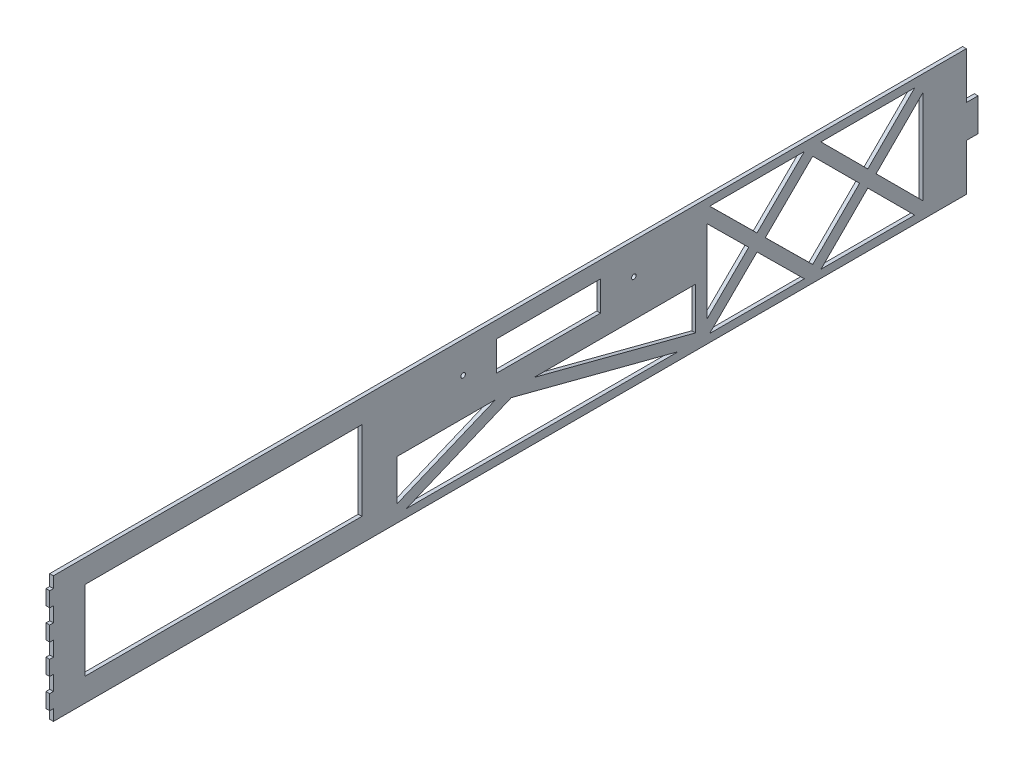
ISO-10303-21;
HEADER;
FILE_DESCRIPTION(('STEP AP214'),'2;1');
FILE_NAME('part.step','',(''),(''),'','','');
FILE_SCHEMA(('AUTOMOTIVE_DESIGN { 1 0 10303 214 1 1 1 1 }'));
ENDSEC;
DATA;
#1=APPLICATION_CONTEXT('core data for automotive mechanical design processes');
#2=APPLICATION_PROTOCOL_DEFINITION('international standard','automotive_design',2000,#1);
#3=PRODUCT_CONTEXT('',#1,'mechanical');
#4=PRODUCT('Part','Part','',(#3));
#5=PRODUCT_RELATED_PRODUCT_CATEGORY('part','',(#4));
#6=PRODUCT_DEFINITION_FORMATION('','',#4);
#7=PRODUCT_DEFINITION_CONTEXT('part definition',#1,'design');
#8=PRODUCT_DEFINITION('design','',#6,#7);
#9=PRODUCT_DEFINITION_SHAPE('','',#8);
#10=(LENGTH_UNIT() NAMED_UNIT(*) SI_UNIT(.MILLI.,.METRE.));
#11=(NAMED_UNIT(*) PLANE_ANGLE_UNIT() SI_UNIT($,.RADIAN.));
#12=(NAMED_UNIT(*) SI_UNIT($,.STERADIAN.) SOLID_ANGLE_UNIT());
#13=UNCERTAINTY_MEASURE_WITH_UNIT(LENGTH_MEASURE(1.E-05),#10,'distance_accuracy_value','');
#14=(GEOMETRIC_REPRESENTATION_CONTEXT(3) GLOBAL_UNCERTAINTY_ASSIGNED_CONTEXT((#13)) GLOBAL_UNIT_ASSIGNED_CONTEXT((#10,
#11,#12)) REPRESENTATION_CONTEXT('',''));
#15=CARTESIAN_POINT('',(0.,0.,0.));
#16=DIRECTION('',(0.,0.,1.));
#17=DIRECTION('',(1.,0.,0.));
#18=AXIS2_PLACEMENT_3D('',#15,#16,#17);
#19=CARTESIAN_POINT('',(804.609864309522,-1.12274408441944E-11,-2.8068602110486E-12));
#20=DIRECTION('',(1.,0.,0.));
#21=DIRECTION('',(0.,1.,0.));
#22=AXIS2_PLACEMENT_3D('',#19,#20,#21);
#23=PLANE('',#22);
#24=DIRECTION('',(0.,1.,0.));
#25=VECTOR('',#24,1.);
#26=CARTESIAN_POINT('',(804.60986430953,-1.12274408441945E-11,2163.87868428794));
#27=LINE('',#26,#25);
#28=CARTESIAN_POINT('',(804.609864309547,1249.47355143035,2163.87868428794));
#29=VERTEX_POINT('',#28);
#30=CARTESIAN_POINT('',(804.609864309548,1274.87355143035,2163.87868428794));
#31=VERTEX_POINT('',#30);
#32=EDGE_CURVE('E1866',#29,#31,#27,.T.);
#33=ORIENTED_EDGE('',*,*,#32,.F.);
#34=DIRECTION('',(0.,0.,-1.));
#35=VECTOR('',#34,1.);
#36=CARTESIAN_POINT('',(804.60986430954,1249.47355143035,-2.80686021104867E-12));
#37=LINE('',#36,#35);
#38=CARTESIAN_POINT('',(804.609864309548,1249.47355143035,2253.05870466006));
#39=VERTEX_POINT('',#38);
#40=EDGE_CURVE('E1864',#39,#29,#37,.T.);
#41=ORIENTED_EDGE('',*,*,#40,.F.);
#42=DIRECTION('',(0.,-1.,0.));
#43=VECTOR('',#42,1.);
#44=CARTESIAN_POINT('',(804.60986430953,-1.12274408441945E-11,2253.05870466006));
#45=LINE('',#44,#43);
#46=CARTESIAN_POINT('',(804.609864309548,1274.87355143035,2253.05870466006));
#47=VERTEX_POINT('',#46);
#48=EDGE_CURVE('E1862',#47,#39,#45,.T.);
#49=ORIENTED_EDGE('',*,*,#48,.F.);
#50=DIRECTION('',(0.,0.,1.));
#51=VECTOR('',#50,1.);
#52=CARTESIAN_POINT('',(804.60986430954,1274.87355143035,-2.80686021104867E-12));
#53=LINE('',#52,#51);
#54=EDGE_CURVE('E1855',#31,#47,#53,.T.);
#55=ORIENTED_EDGE('',*,*,#54,.F.);
#56=EDGE_LOOP('',(#33,#41,#49,#55));
#57=FACE_BOUND('',#56,.T.);
#58=DIRECTION('',(0.,-0.703622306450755,-0.710574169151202));
#59=VECTOR('',#58,1.);
#60=CARTESIAN_POINT('',(804.609864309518,-387.921155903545,384.125950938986));
#61=LINE('',#60,#59);
#62=CARTESIAN_POINT('',(804.609864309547,1234.9155514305,2022.99645633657));
#63=VERTEX_POINT('',#62);
#64=CARTESIAN_POINT('',(804.609864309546,1194.81928209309,1982.50403162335));
#65=VERTEX_POINT('',#64);
#66=EDGE_CURVE('E1923',#63,#65,#61,.T.);
#67=ORIENTED_EDGE('',*,*,#66,.F.);
#68=DIRECTION('',(0.,-0.703622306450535,0.710574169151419));
#69=VECTOR('',#68,1.);
#70=CARTESIAN_POINT('',(804.609864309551,1634.97753226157,1618.9818208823));
#71=LINE('',#70,#69);
#72=CARTESIAN_POINT('',(804.609864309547,1275.01182076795,1982.5040316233));
#73=VERTEX_POINT('',#72);
#74=EDGE_CURVE('E1932',#73,#63,#71,.T.);
#75=ORIENTED_EDGE('',*,*,#74,.F.);
#76=DIRECTION('',(0.,0.707106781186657,0.707106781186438));
#77=VECTOR('',#76,1.);
#78=CARTESIAN_POINT('',(804.609864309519,-353.746105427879,353.746105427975));
#79=LINE('',#78,#77);
#80=CARTESIAN_POINT('',(804.609864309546,1234.91555143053,1942.4077622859));
#81=VERTEX_POINT('',#80);
#82=EDGE_CURVE('E1929',#81,#73,#79,.T.);
#83=ORIENTED_EDGE('',*,*,#82,.F.);
#84=DIRECTION('',(0.,0.707106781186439,-0.707106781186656));
#85=VECTOR('',#84,1.);
#86=CARTESIAN_POINT('',(804.60986430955,1588.6616568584,1588.66165685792));
#87=LINE('',#86,#85);
#88=EDGE_CURVE('E1925',#65,#81,#87,.T.);
#89=ORIENTED_EDGE('',*,*,#88,.F.);
#90=EDGE_LOOP('',(#67,#75,#83,#89));
#91=FACE_BOUND('',#90,.T.);
#92=DIRECTION('',(0.,0.,-1.));
#93=VECTOR('',#92,1.);
#94=CARTESIAN_POINT('',(804.609864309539,1187.76555143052,-2.85157023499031E-12));
#95=LINE('',#94,#93);
#96=CARTESIAN_POINT('',(804.609864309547,1187.76555143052,2330.02614964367));
#97=VERTEX_POINT('',#96);
#98=CARTESIAN_POINT('',(804.609864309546,1187.76555143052,2097.50344332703));
#99=VERTEX_POINT('',#98);
#100=EDGE_CURVE('E1972',#97,#99,#95,.T.);
#101=ORIENTED_EDGE('',*,*,#100,.F.);
#102=DIRECTION('',(0.,-0.383705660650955,0.923455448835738));
#103=VECTOR('',#102,1.);
#104=CARTESIAN_POINT('',(804.609864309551,1838.50079819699,763.91683461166));
#105=LINE('',#104,#103);
#106=CARTESIAN_POINT('',(804.609864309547,1225.05722248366,2240.27715617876));
#107=VERTEX_POINT('',#106);
#108=EDGE_CURVE('E1981',#107,#97,#105,.T.);
#109=ORIENTED_EDGE('',*,*,#108,.F.);
#110=DIRECTION('',(0.,0.252716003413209,0.967540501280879));
#111=VECTOR('',#110,1.);
#112=CARTESIAN_POINT('',(804.60986430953,599.041661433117,-156.466229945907));
#113=LINE('',#112,#111);
#114=EDGE_CURVE('E1978',#99,#107,#113,.T.);
#115=ORIENTED_EDGE('',*,*,#114,.F.);
#116=EDGE_LOOP('',(#101,#109,#115));
#117=FACE_BOUND('',#116,.T.);
#118=CARTESIAN_POINT('',(804.609864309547,1262.17355143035,2135.443694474));
#119=DIRECTION('',(1.,0.,0.));
#120=DIRECTION('',(0.,1.,0.));
#121=AXIS2_PLACEMENT_3D('',#118,#119,#120);
#122=CIRCLE('',#121,1.98120000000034);
#123=CARTESIAN_POINT('',(804.609864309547,1264.15475143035,2135.443694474));
#124=VERTEX_POINT('',#123);
#125=EDGE_CURVE('E1868',#124,#124,#122,.T.);
#126=ORIENTED_EDGE('',*,*,#125,.F.);
#127=EDGE_LOOP('',(#126));
#128=FACE_BOUND('',#127,.T.);
#129=CARTESIAN_POINT('',(804.609864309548,1262.17355143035,2281.493694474));
#130=DIRECTION('',(1.,0.,0.));
#131=DIRECTION('',(0.,1.,0.));
#132=AXIS2_PLACEMENT_3D('',#129,#130,#131);
#133=CIRCLE('',#132,1.98120000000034);
#134=CARTESIAN_POINT('',(804.609864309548,1264.15475143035,2281.493694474));
#135=VERTEX_POINT('',#134);
#136=EDGE_CURVE('E1871',#135,#135,#133,.T.);
#137=ORIENTED_EDGE('',*,*,#136,.F.);
#138=EDGE_LOOP('',(#137));
#139=FACE_BOUND('',#138,.T.);
#140=DIRECTION('',(0.,-1.,0.));
#141=VECTOR('',#140,1.);
#142=CARTESIAN_POINT('',(804.609864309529,-1.12274408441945E-11,1851.100060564));
#143=LINE('',#142,#141);
#144=CARTESIAN_POINT('',(804.609864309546,1220.94555143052,1851.100060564));
#145=VERTEX_POINT('',#144);
#146=CARTESIAN_POINT('',(804.609864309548,1181.02055143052,1851.100060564));
#147=VERTEX_POINT('',#146);
#148=EDGE_CURVE('E2063',#145,#147,#143,.T.);
#149=ORIENTED_EDGE('',*,*,#148,.F.);
#150=DIRECTION('',(0.,0.,1.));
#151=VECTOR('',#150,1.);
#152=CARTESIAN_POINT('',(804.609864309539,1220.94555143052,-2.80686021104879E-12));
#153=LINE('',#152,#151);
#154=CARTESIAN_POINT('',(804.609864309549,1220.94555143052,1841.100060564));
#155=VERTEX_POINT('',#154);
#156=EDGE_CURVE('E2058',#155,#145,#153,.T.);
#157=ORIENTED_EDGE('',*,*,#156,.F.);
#158=DIRECTION('',(0.,1.,0.));
#159=VECTOR('',#158,1.);
#160=CARTESIAN_POINT('',(804.609864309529,-1.12274408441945E-11,1841.100060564));
#161=LINE('',#160,#159);
#162=CARTESIAN_POINT('',(804.609864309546,1249.04555143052,1841.100060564));
#163=VERTEX_POINT('',#162);
#164=EDGE_CURVE('E2065',#155,#163,#161,.T.);
#165=ORIENTED_EDGE('',*,*,#164,.T.);
#166=DIRECTION('',(0.,0.,1.));
#167=VECTOR('',#166,1.);
#168=CARTESIAN_POINT('',(804.60986430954,1249.04555143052,-2.8068602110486E-12));
#169=LINE('',#168,#167);
#170=CARTESIAN_POINT('',(804.609864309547,1249.04555143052,1851.100060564));
#171=VERTEX_POINT('',#170);
#172=EDGE_CURVE('E2052',#163,#171,#169,.T.);
#173=ORIENTED_EDGE('',*,*,#172,.T.);
#174=DIRECTION('',(0.,1.,0.));
#175=VECTOR('',#174,1.);
#176=CARTESIAN_POINT('',(804.609864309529,-1.12274408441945E-11,1851.100060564));
#177=LINE('',#176,#175);
#178=CARTESIAN_POINT('',(804.60986430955,1288.97055143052,1851.100060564));
#179=VERTEX_POINT('',#178);
#180=EDGE_CURVE('E2060',#171,#179,#177,.T.);
#181=ORIENTED_EDGE('',*,*,#180,.T.);
#182=DIRECTION('',(0.,0.,-1.));
#183=VECTOR('',#182,1.);
#184=CARTESIAN_POINT('',(804.609864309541,1288.97055143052,-2.78526615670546E-12));
#185=LINE('',#184,#183);
#186=CARTESIAN_POINT('',(804.60986430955,1288.97055143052,2631.886694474));
#187=VERTEX_POINT('',#186);
#188=EDGE_CURVE('E2113',#187,#179,#185,.T.);
#189=ORIENTED_EDGE('',*,*,#188,.F.);
#190=DIRECTION('',(0.,1.,0.));
#191=VECTOR('',#190,1.);
#192=CARTESIAN_POINT('',(804.609864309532,-1.12558159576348E-11,2631.886694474));
#193=LINE('',#192,#191);
#194=CARTESIAN_POINT('',(804.609864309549,1279.44555143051,2631.886694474));
#195=VERTEX_POINT('',#194);
#196=EDGE_CURVE('E2188',#195,#187,#193,.T.);
#197=ORIENTED_EDGE('',*,*,#196,.F.);
#198=DIRECTION('',(0.,0.,1.));
#199=VECTOR('',#198,1.);
#200=CARTESIAN_POINT('',(804.60986430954,1279.44555143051,-2.78369641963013E-12));
#201=LINE('',#200,#199);
#202=CARTESIAN_POINT('',(804.609864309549,1279.44555143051,2635.061694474));
#203=VERTEX_POINT('',#202);
#204=EDGE_CURVE('E2119',#195,#203,#201,.T.);
#205=ORIENTED_EDGE('',*,*,#204,.T.);
#206=DIRECTION('',(0.,-1.,0.));
#207=VECTOR('',#206,1.);
#208=CARTESIAN_POINT('',(804.609864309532,-1.12274408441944E-11,2635.061694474));
#209=LINE('',#208,#207);
#210=CARTESIAN_POINT('',(804.609864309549,1266.74555143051,2635.061694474));
#211=VERTEX_POINT('',#210);
#212=EDGE_CURVE('E2197',#203,#211,#209,.T.);
#213=ORIENTED_EDGE('',*,*,#212,.T.);
#214=DIRECTION('',(0.,0.,-1.));
#215=VECTOR('',#214,1.);
#216=CARTESIAN_POINT('',(804.60986430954,1266.74555143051,-2.78369641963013E-12));
#217=LINE('',#216,#215);
#218=CARTESIAN_POINT('',(804.609864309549,1266.74555143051,2631.886694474));
#219=VERTEX_POINT('',#218);
#220=EDGE_CURVE('E2176',#211,#219,#217,.T.);
#221=ORIENTED_EDGE('',*,*,#220,.T.);
#222=DIRECTION('',(0.,1.,0.));
#223=VECTOR('',#222,1.);
#224=CARTESIAN_POINT('',(804.609864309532,-1.1255815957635E-11,2631.886694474));
#225=LINE('',#224,#223);
#226=CARTESIAN_POINT('',(804.609864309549,1254.04555143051,2631.886694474));
#227=VERTEX_POINT('',#226);
#228=EDGE_CURVE('E2172',#227,#219,#225,.T.);
#229=ORIENTED_EDGE('',*,*,#228,.F.);
#230=DIRECTION('',(0.,0.,-1.));
#231=VECTOR('',#230,1.);
#232=CARTESIAN_POINT('',(804.60986430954,1254.04555143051,-2.78369641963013E-12));
#233=LINE('',#232,#231);
#234=CARTESIAN_POINT('',(804.609864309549,1254.04555143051,2635.061694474));
#235=VERTEX_POINT('',#234);
#236=EDGE_CURVE('E2169',#235,#227,#233,.T.);
#237=ORIENTED_EDGE('',*,*,#236,.F.);
#238=CARTESIAN_POINT('',(804.609864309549,1241.34555143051,2635.061694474));
#239=VERTEX_POINT('',#238);
#240=EDGE_CURVE('E2671',#235,#239,#209,.T.);
#241=ORIENTED_EDGE('',*,*,#240,.T.);
#242=DIRECTION('',(0.,0.,-1.));
#243=VECTOR('',#242,1.);
#244=CARTESIAN_POINT('',(804.60986430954,1241.34555143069,8.40301878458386E-11));
#245=LINE('',#244,#243);
#246=CARTESIAN_POINT('',(804.609864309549,1241.34555143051,2631.886694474));
#247=VERTEX_POINT('',#246);
#248=EDGE_CURVE('E2159',#239,#247,#245,.T.);
#249=ORIENTED_EDGE('',*,*,#248,.T.);
#250=DIRECTION('',(0.,1.,0.));
#251=VECTOR('',#250,1.);
#252=CARTESIAN_POINT('',(804.609864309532,-1.1255815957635E-11,2631.886694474));
#253=LINE('',#252,#251);
#254=CARTESIAN_POINT('',(804.609864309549,1228.64555143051,2631.886694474));
#255=VERTEX_POINT('',#254);
#256=EDGE_CURVE('E2155',#255,#247,#253,.T.);
#257=ORIENTED_EDGE('',*,*,#256,.F.);
#258=DIRECTION('',(0.,0.,-1.));
#259=VECTOR('',#258,1.);
#260=CARTESIAN_POINT('',(804.60986430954,1228.64555143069,8.31420094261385E-11));
#261=LINE('',#260,#259);
#262=CARTESIAN_POINT('',(804.609864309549,1228.64555143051,2635.061694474));
#263=VERTEX_POINT('',#262);
#264=EDGE_CURVE('E2152',#263,#255,#261,.T.);
#265=ORIENTED_EDGE('',*,*,#264,.F.);
#266=CARTESIAN_POINT('',(804.609864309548,1215.94555143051,2635.061694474));
#267=VERTEX_POINT('',#266);
#268=EDGE_CURVE('E2196',#263,#267,#209,.T.);
#269=ORIENTED_EDGE('',*,*,#268,.T.);
#270=DIRECTION('',(0.,0.,-1.));
#271=VECTOR('',#270,1.);
#272=CARTESIAN_POINT('',(804.609864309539,1215.94555143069,8.22538310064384E-11));
#273=LINE('',#272,#271);
#274=CARTESIAN_POINT('',(804.609864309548,1215.94555143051,2631.886694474));
#275=VERTEX_POINT('',#274);
#276=EDGE_CURVE('E2142',#267,#275,#273,.T.);
#277=ORIENTED_EDGE('',*,*,#276,.T.);
#278=DIRECTION('',(0.,1.,0.));
#279=VECTOR('',#278,1.);
#280=CARTESIAN_POINT('',(804.609864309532,-1.1255815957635E-11,2631.886694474));
#281=LINE('',#280,#279);
#282=CARTESIAN_POINT('',(804.609864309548,1203.24555143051,2631.886694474));
#283=VERTEX_POINT('',#282);
#284=EDGE_CURVE('E2138',#283,#275,#281,.T.);
#285=ORIENTED_EDGE('',*,*,#284,.F.);
#286=DIRECTION('',(0.,0.,-1.));
#287=VECTOR('',#286,1.);
#288=CARTESIAN_POINT('',(804.609864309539,1203.24555143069,8.13656525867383E-11));
#289=LINE('',#288,#287);
#290=CARTESIAN_POINT('',(804.609864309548,1203.24555143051,2635.061694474));
#291=VERTEX_POINT('',#290);
#292=EDGE_CURVE('E2135',#291,#283,#289,.T.);
#293=ORIENTED_EDGE('',*,*,#292,.F.);
#294=CARTESIAN_POINT('',(804.609864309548,1190.54555143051,2635.061694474));
#295=VERTEX_POINT('',#294);
#296=EDGE_CURVE('E2133',#291,#295,#209,.T.);
#297=ORIENTED_EDGE('',*,*,#296,.T.);
#298=DIRECTION('',(0.,1.39870617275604E-13,-1.));
#299=VECTOR('',#298,1.);
#300=CARTESIAN_POINT('',(804.609864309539,1190.54555143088,1.63738644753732E-10));
#301=LINE('',#300,#299);
#302=CARTESIAN_POINT('',(804.609864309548,1190.54555143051,2631.886694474));
#303=VERTEX_POINT('',#302);
#304=EDGE_CURVE('E2126',#295,#303,#301,.T.);
#305=ORIENTED_EDGE('',*,*,#304,.T.);
#306=DIRECTION('',(0.,1.,-1.14161750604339E-13));
#307=VECTOR('',#306,1.);
#308=CARTESIAN_POINT('',(804.609864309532,2.892049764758E-10,2631.88669447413));
#309=LINE('',#308,#307);
#310=CARTESIAN_POINT('',(804.609864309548,1181.02055143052,2631.886694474));
#311=VERTEX_POINT('',#310);
#312=EDGE_CURVE('E2123',#311,#303,#309,.T.);
#313=ORIENTED_EDGE('',*,*,#312,.F.);
#314=DIRECTION('',(0.,0.,-1.));
#315=VECTOR('',#314,1.);
#316=CARTESIAN_POINT('',(804.609864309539,1181.02055143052,-2.78526615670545E-12));
#317=LINE('',#316,#315);
#318=EDGE_CURVE('E2112',#311,#147,#317,.T.);
#319=ORIENTED_EDGE('',*,*,#318,.T.);
#320=EDGE_LOOP('',(#149,#157,#165,#173,#181,#189,#197,#205,#213,#221,#229,#237,#241,#249,#257,
#265,#269,#277,#285,#293,#297,#305,#313,#319));
#321=FACE_BOUND('',#320,.T.);
#322=DIRECTION('',(0.,-0.383705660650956,0.923455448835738));
#323=VECTOR('',#322,1.);
#324=CARTESIAN_POINT('',(804.609864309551,1847.73535268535,767.753891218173));
#325=LINE('',#324,#323);
#326=CARTESIAN_POINT('',(804.609864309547,1230.32018750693,2253.67254436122));
#327=VERTEX_POINT('',#326);
#328=CARTESIAN_POINT('',(804.609864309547,1195.25755151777,2338.05697121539));
#329=VERTEX_POINT('',#328);
#330=EDGE_CURVE('E2024',#327,#329,#325,.T.);
#331=ORIENTED_EDGE('',*,*,#330,.T.);
#332=DIRECTION('',(0.,1.,0.));
#333=VECTOR('',#332,1.);
#334=CARTESIAN_POINT('',(804.609864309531,-1.12637024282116E-11,2338.05697121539));
#335=LINE('',#334,#333);
#336=CARTESIAN_POINT('',(804.609864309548,1230.32018750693,2338.05697121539));
#337=VERTEX_POINT('',#336);
#338=EDGE_CURVE('E1987',#329,#337,#335,.T.);
#339=ORIENTED_EDGE('',*,*,#338,.T.);
#340=DIRECTION('',(0.,0.,1.));
#341=VECTOR('',#340,1.);
#342=CARTESIAN_POINT('',(804.609864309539,1230.32018750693,-2.25099030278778E-12));
#343=LINE('',#342,#341);
#344=EDGE_CURVE('E2027',#327,#337,#343,.T.);
#345=ORIENTED_EDGE('',*,*,#344,.F.);
#346=EDGE_LOOP('',(#331,#339,#345));
#347=FACE_BOUND('',#346,.T.);
#348=DIRECTION('',(0.,0.707106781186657,0.707106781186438));
#349=VECTOR('',#348,1.);
#350=CARTESIAN_POINT('',(804.609864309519,-346.675037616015,346.675037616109));
#351=LINE('',#350,#349);
#352=CARTESIAN_POINT('',(804.609864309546,1194.83661924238,1888.18669447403));
#353=VERTEX_POINT('',#352);
#354=CARTESIAN_POINT('',(804.609864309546,1234.91555143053,1928.26562666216));
#355=VERTEX_POINT('',#354);
#356=EDGE_CURVE('E1875',#353,#355,#351,.T.);
#357=ORIENTED_EDGE('',*,*,#356,.T.);
#358=DIRECTION('',(0.,0.707106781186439,-0.707106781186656));
#359=VECTOR('',#358,1.);
#360=CARTESIAN_POINT('',(804.60986430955,1581.59058904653,1581.59058904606));
#361=LINE('',#360,#359);
#362=CARTESIAN_POINT('',(804.609864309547,1274.99448361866,1888.18669447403));
#363=VERTEX_POINT('',#362);
#364=EDGE_CURVE('E1872',#355,#363,#361,.T.);
#365=ORIENTED_EDGE('',*,*,#364,.T.);
#366=DIRECTION('',(0.,1.,0.));
#367=VECTOR('',#366,1.);
#368=CARTESIAN_POINT('',(804.609864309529,-1.12637024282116E-11,1888.18669447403));
#369=LINE('',#368,#367);
#370=EDGE_CURVE('E1878',#353,#363,#369,.T.);
#371=ORIENTED_EDGE('',*,*,#370,.F.);
#372=EDGE_LOOP('',(#357,#365,#371));
#373=FACE_BOUND('',#372,.T.);
#374=DIRECTION('',(0.,1.,0.));
#375=VECTOR('',#374,1.);
#376=CARTESIAN_POINT('',(804.609864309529,-1.12637024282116E-11,2082.71838843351));
#377=LINE('',#376,#375);
#378=CARTESIAN_POINT('',(804.609864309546,1194.23926494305,2082.71838843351));
#379=VERTEX_POINT('',#378);
#380=CARTESIAN_POINT('',(804.609864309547,1230.32018750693,2082.71838843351));
#381=VERTEX_POINT('',#380);
#382=EDGE_CURVE('E1962',#379,#381,#377,.T.);
#383=ORIENTED_EDGE('',*,*,#382,.F.);
#384=DIRECTION('',(0.,0.252716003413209,0.967540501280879));
#385=VECTOR('',#384,1.);
#386=CARTESIAN_POINT('',(804.60986430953,608.717066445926,-158.993389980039));
#387=LINE('',#386,#385);
#388=CARTESIAN_POINT('',(804.609864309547,1230.32018750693,2220.85666789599));
#389=VERTEX_POINT('',#388);
#390=EDGE_CURVE('E1959',#379,#389,#387,.T.);
#391=ORIENTED_EDGE('',*,*,#390,.T.);
#392=DIRECTION('',(0.,0.,1.));
#393=VECTOR('',#392,1.);
#394=CARTESIAN_POINT('',(804.609864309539,1230.32018750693,-2.25099030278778E-12));
#395=LINE('',#394,#393);
#396=EDGE_CURVE('E1966',#381,#389,#395,.T.);
#397=ORIENTED_EDGE('',*,*,#396,.F.);
#398=EDGE_LOOP('',(#383,#391,#397));
#399=FACE_BOUND('',#398,.T.);
#400=DIRECTION('',(0.,-0.703622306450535,0.710574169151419));
#401=VECTOR('',#400,1.);
#402=CARTESIAN_POINT('',(804.609864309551,1634.97753226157,1618.9818208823));
#403=LINE('',#402,#401);
#404=CARTESIAN_POINT('',(804.609864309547,1227.8789883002,2030.10254145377));
#405=VERTEX_POINT('',#404);
#406=CARTESIAN_POINT('',(804.609864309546,1187.76555143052,2070.61230331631));
#407=VERTEX_POINT('',#406);
#408=EDGE_CURVE('E1995',#405,#407,#403,.T.);
#409=ORIENTED_EDGE('',*,*,#408,.F.);
#410=DIRECTION('',(0.,-0.703622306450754,-0.710574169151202));
#411=VECTOR('',#410,1.);
#412=CARTESIAN_POINT('',(804.609864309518,-395.026897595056,391.162174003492));
#413=LINE('',#412,#411);
#414=CARTESIAN_POINT('',(804.609864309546,1187.76555143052,1989.59277959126));
#415=VERTEX_POINT('',#414);
#416=EDGE_CURVE('E1992',#405,#415,#413,.T.);
#417=ORIENTED_EDGE('',*,*,#416,.T.);
#418=DIRECTION('',(0.,0.,-1.));
#419=VECTOR('',#418,1.);
#420=CARTESIAN_POINT('',(804.609864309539,1187.76555143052,-2.85157023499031E-12));
#421=LINE('',#420,#419);
#422=EDGE_CURVE('E1999',#407,#415,#421,.T.);
#423=ORIENTED_EDGE('',*,*,#422,.F.);
#424=EDGE_LOOP('',(#409,#417,#423));
#425=FACE_BOUND('',#424,.T.);
#426=DIRECTION('',(0.,0.,1.));
#427=VECTOR('',#426,1.);
#428=CARTESIAN_POINT('',(804.60986430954,1282.06555143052,-2.85157023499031E-12));
#429=LINE('',#428,#427);
#430=CARTESIAN_POINT('',(804.609864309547,1282.06555143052,1989.59277959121));
#431=VERTEX_POINT('',#430);
#432=CARTESIAN_POINT('',(804.609864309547,1282.06555143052,2070.61230331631));
#433=VERTEX_POINT('',#432);
#434=EDGE_CURVE('E2010',#431,#433,#429,.T.);
#435=ORIENTED_EDGE('',*,*,#434,.F.);
#436=DIRECTION('',(0.,-0.703622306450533,0.710574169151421));
#437=VECTOR('',#436,1.);
#438=CARTESIAN_POINT('',(804.609864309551,1642.08327395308,1626.0180439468));
#439=LINE('',#438,#437);
#440=CARTESIAN_POINT('',(804.609864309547,1241.95211456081,2030.10254145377));
#441=VERTEX_POINT('',#440);
#442=EDGE_CURVE('E1938',#431,#441,#439,.T.);
#443=ORIENTED_EDGE('',*,*,#442,.T.);
#444=DIRECTION('',(0.,-0.703622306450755,-0.710574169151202));
#445=VECTOR('',#444,1.);
#446=CARTESIAN_POINT('',(804.609864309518,-387.921155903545,384.125950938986));
#447=LINE('',#446,#445);
#448=EDGE_CURVE('E2013',#433,#441,#447,.T.);
#449=ORIENTED_EDGE('',*,*,#448,.F.);
#450=EDGE_LOOP('',(#435,#443,#449));
#451=FACE_BOUND('',#450,.T.);
#452=DIRECTION('',(0.,0.,-1.));
#453=VECTOR('',#452,1.);
#454=CARTESIAN_POINT('',(804.609864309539,1187.76555143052,-2.85157023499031E-12));
#455=LINE('',#454,#453);
#456=CARTESIAN_POINT('',(804.609864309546,1187.76555143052,1975.4156266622));
#457=VERTEX_POINT('',#456);
#458=CARTESIAN_POINT('',(804.609864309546,1187.76555143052,1895.25776228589));
#459=VERTEX_POINT('',#458);
#460=EDGE_CURVE('E1911',#457,#459,#455,.T.);
#461=ORIENTED_EDGE('',*,*,#460,.F.);
#462=DIRECTION('',(0.,0.707106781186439,-0.707106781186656));
#463=VECTOR('',#462,1.);
#464=CARTESIAN_POINT('',(804.60986430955,1581.59058904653,1581.59058904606));
#465=LINE('',#464,#463);
#466=CARTESIAN_POINT('',(804.609864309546,1227.84448361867,1935.33669447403));
#467=VERTEX_POINT('',#466);
#468=EDGE_CURVE('E1884',#457,#467,#465,.T.);
#469=ORIENTED_EDGE('',*,*,#468,.T.);
#470=DIRECTION('',(0.,0.707106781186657,0.707106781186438));
#471=VECTOR('',#470,1.);
#472=CARTESIAN_POINT('',(804.609864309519,-353.746105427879,353.746105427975));
#473=LINE('',#472,#471);
#474=EDGE_CURVE('E1914',#459,#467,#473,.T.);
#475=ORIENTED_EDGE('',*,*,#474,.F.);
#476=EDGE_LOOP('',(#461,#469,#475));
#477=FACE_BOUND('',#476,.T.);
#478=DIRECTION('',(0.,0.707106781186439,-0.707106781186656));
#479=VECTOR('',#478,1.);
#480=CARTESIAN_POINT('',(804.60986430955,1588.6616568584,1588.66165685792));
#481=LINE('',#480,#479);
#482=CARTESIAN_POINT('',(804.609864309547,1241.9866192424,1935.33669447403));
#483=VERTEX_POINT('',#482);
#484=CARTESIAN_POINT('',(804.609864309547,1282.06555143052,1895.2577622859));
#485=VERTEX_POINT('',#484);
#486=EDGE_CURVE('E1894',#483,#485,#481,.T.);
#487=ORIENTED_EDGE('',*,*,#486,.F.);
#488=DIRECTION('',(0.,0.707106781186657,0.707106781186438));
#489=VECTOR('',#488,1.);
#490=CARTESIAN_POINT('',(804.609864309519,-346.675037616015,346.675037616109));
#491=LINE('',#490,#489);
#492=CARTESIAN_POINT('',(804.609864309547,1282.06555143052,1975.41562666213));
#493=VERTEX_POINT('',#492);
#494=EDGE_CURVE('E1891',#483,#493,#491,.T.);
#495=ORIENTED_EDGE('',*,*,#494,.T.);
#496=DIRECTION('',(0.,0.,1.));
#497=VECTOR('',#496,1.);
#498=CARTESIAN_POINT('',(804.60986430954,1282.06555143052,-2.85157023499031E-12));
#499=LINE('',#498,#497);
#500=EDGE_CURVE('E1898',#485,#493,#499,.T.);
#501=ORIENTED_EDGE('',*,*,#500,.F.);
#502=EDGE_LOOP('',(#487,#495,#501));
#503=FACE_BOUND('',#502,.T.);
#504=DIRECTION('',(0.,-0.703622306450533,0.710574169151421));
#505=VECTOR('',#504,1.);
#506=CARTESIAN_POINT('',(804.609864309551,1642.08327395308,1626.0180439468));
#507=LINE('',#506,#505);
#508=CARTESIAN_POINT('',(804.609864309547,1234.91555143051,2037.20862657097));
#509=VERTEX_POINT('',#508);
#510=CARTESIAN_POINT('',(804.609864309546,1199.75319734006,2072.71838843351));
#511=VERTEX_POINT('',#510);
#512=EDGE_CURVE('E1947',#509,#511,#507,.T.);
#513=ORIENTED_EDGE('',*,*,#512,.T.);
#514=DIRECTION('',(0.,1.,0.));
#515=VECTOR('',#514,1.);
#516=CARTESIAN_POINT('',(804.609864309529,-1.12637024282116E-11,2072.71838843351));
#517=LINE('',#516,#515);
#518=CARTESIAN_POINT('',(804.609864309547,1270.07790552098,2072.71838843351));
#519=VERTEX_POINT('',#518);
#520=EDGE_CURVE('E1904',#511,#519,#517,.T.);
#521=ORIENTED_EDGE('',*,*,#520,.T.);
#522=DIRECTION('',(0.,-0.703622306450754,-0.710574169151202));
#523=VECTOR('',#522,1.);
#524=CARTESIAN_POINT('',(804.609864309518,-395.026897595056,391.162174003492));
#525=LINE('',#524,#523);
#526=EDGE_CURVE('E1950',#519,#509,#525,.T.);
#527=ORIENTED_EDGE('',*,*,#526,.T.);
#528=EDGE_LOOP('',(#513,#521,#527));
#529=FACE_BOUND('',#528,.T.);
#530=DIRECTION('',(0.,1.,0.));
#531=VECTOR('',#530,1.);
#532=CARTESIAN_POINT('',(804.609864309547,1201.02055143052,2368.05697121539));
#533=LINE('',#532,#531);
#534=CARTESIAN_POINT('',(804.609864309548,1201.02055143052,2368.05697121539));
#535=VERTEX_POINT('',#534);
#536=CARTESIAN_POINT('',(804.609864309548,1268.97055143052,2368.05697121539));
#537=VERTEX_POINT('',#536);
#538=EDGE_CURVE('E1831',#535,#537,#533,.T.);
#539=ORIENTED_EDGE('',*,*,#538,.F.);
#540=DIRECTION('',(0.,0.,-1.));
#541=VECTOR('',#540,1.);
#542=CARTESIAN_POINT('',(804.609864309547,1201.02055143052,2368.05697121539));
#543=LINE('',#542,#541);
#544=CARTESIAN_POINT('',(804.609864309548,1201.02055143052,2605.061694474));
#545=VERTEX_POINT('',#544);
#546=EDGE_CURVE('E1837',#545,#535,#543,.T.);
#547=ORIENTED_EDGE('',*,*,#546,.F.);
#548=DIRECTION('',(0.,-1.,0.));
#549=VECTOR('',#548,1.);
#550=CARTESIAN_POINT('',(804.609864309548,1201.02055143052,2605.061694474));
#551=LINE('',#550,#549);
#552=CARTESIAN_POINT('',(804.609864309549,1268.97055143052,2605.061694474));
#553=VERTEX_POINT('',#552);
#554=EDGE_CURVE('E1840',#553,#545,#551,.T.);
#555=ORIENTED_EDGE('',*,*,#554,.F.);
#556=DIRECTION('',(0.,0.,1.));
#557=VECTOR('',#556,1.);
#558=CARTESIAN_POINT('',(804.609864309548,1268.97055143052,2368.05697121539));
#559=LINE('',#558,#557);
#560=EDGE_CURVE('E1822',#537,#553,#559,.T.);
#561=ORIENTED_EDGE('',*,*,#560,.F.);
#562=EDGE_LOOP('',(#539,#547,#555,#561));
#563=FACE_BOUND('',#562,.T.);
#564=ADVANCED_FACE('F1422',(#57,#91,#117,#128,#139,#321,#347,#373,#399,#425,#451,#477,#503,#529,
#563),#23,.T.);
#565=CARTESIAN_POINT('',(801.434864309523,-1.11292460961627E-11,-2.75573985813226E-12));
#566=DIRECTION('',(1.,0.,0.));
#567=DIRECTION('',(0.,1.,0.));
#568=AXIS2_PLACEMENT_3D('',#565,#566,#567);
#569=PLANE('',#568);
#570=DIRECTION('',(0.,1.,0.));
#571=VECTOR('',#570,1.);
#572=CARTESIAN_POINT('',(801.43486430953,-1.11292460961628E-11,2072.71838843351));
#573=LINE('',#572,#571);
#574=CARTESIAN_POINT('',(801.434864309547,1199.75319734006,2072.71838843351));
#575=VERTEX_POINT('',#574);
#576=CARTESIAN_POINT('',(801.434864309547,1270.07790552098,2072.71838843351));
#577=VERTEX_POINT('',#576);
#578=EDGE_CURVE('E2285',#575,#577,#573,.T.);
#579=ORIENTED_EDGE('',*,*,#578,.F.);
#580=DIRECTION('',(0.,-0.703622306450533,0.710574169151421));
#581=VECTOR('',#580,1.);
#582=CARTESIAN_POINT('',(801.434864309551,1642.08327395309,1626.0180439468));
#583=LINE('',#582,#581);
#584=CARTESIAN_POINT('',(801.434864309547,1234.91555143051,2037.20862657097));
#585=VERTEX_POINT('',#584);
#586=EDGE_CURVE('E2280',#585,#575,#583,.T.);
#587=ORIENTED_EDGE('',*,*,#586,.F.);
#588=DIRECTION('',(0.,-0.703622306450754,-0.710574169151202));
#589=VECTOR('',#588,1.);
#590=CARTESIAN_POINT('',(801.434864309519,-395.026897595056,391.162174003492));
#591=LINE('',#590,#589);
#592=EDGE_CURVE('E2282',#577,#585,#591,.T.);
#593=ORIENTED_EDGE('',*,*,#592,.F.);
#594=EDGE_LOOP('',(#579,#587,#593));
#595=FACE_BOUND('',#594,.T.);
#596=DIRECTION('',(0.,0.707106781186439,-0.707106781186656));
#597=VECTOR('',#596,1.);
#598=CARTESIAN_POINT('',(801.43486430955,1581.59058904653,1581.59058904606));
#599=LINE('',#598,#597);
#600=CARTESIAN_POINT('',(801.434864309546,1187.76555143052,1975.4156266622));
#601=VERTEX_POINT('',#600);
#602=CARTESIAN_POINT('',(801.434864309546,1227.84448361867,1935.33669447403));
#603=VERTEX_POINT('',#602);
#604=EDGE_CURVE('E2270',#601,#603,#599,.T.);
#605=ORIENTED_EDGE('',*,*,#604,.F.);
#606=DIRECTION('',(0.,0.,-1.));
#607=VECTOR('',#606,1.);
#608=CARTESIAN_POINT('',(801.434864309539,1187.76555143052,-2.75573985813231E-12));
#609=LINE('',#608,#607);
#610=CARTESIAN_POINT('',(801.434864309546,1187.76555143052,1895.25776228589));
#611=VERTEX_POINT('',#610);
#612=EDGE_CURVE('E2264',#601,#611,#609,.T.);
#613=ORIENTED_EDGE('',*,*,#612,.T.);
#614=DIRECTION('',(0.,0.707106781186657,0.707106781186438));
#615=VECTOR('',#614,1.);
#616=CARTESIAN_POINT('',(801.434864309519,-353.746105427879,353.746105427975));
#617=LINE('',#616,#615);
#618=EDGE_CURVE('E2267',#611,#603,#617,.T.);
#619=ORIENTED_EDGE('',*,*,#618,.T.);
#620=EDGE_LOOP('',(#605,#613,#619));
#621=FACE_BOUND('',#620,.T.);
#622=DIRECTION('',(0.,-0.703622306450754,-0.710574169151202));
#623=VECTOR('',#622,1.);
#624=CARTESIAN_POINT('',(801.434864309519,-395.026897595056,391.162174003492));
#625=LINE('',#624,#623);
#626=CARTESIAN_POINT('',(801.434864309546,1227.8789883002,2030.10254145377));
#627=VERTEX_POINT('',#626);
#628=CARTESIAN_POINT('',(801.434864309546,1187.76555143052,1989.59277959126));
#629=VERTEX_POINT('',#628);
#630=EDGE_CURVE('E2254',#627,#629,#625,.T.);
#631=ORIENTED_EDGE('',*,*,#630,.F.);
#632=DIRECTION('',(0.,-0.703622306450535,0.710574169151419));
#633=VECTOR('',#632,1.);
#634=CARTESIAN_POINT('',(801.434864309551,1634.97753226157,1618.9818208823));
#635=LINE('',#634,#633);
#636=CARTESIAN_POINT('',(801.434864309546,1187.76555143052,2070.61230331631));
#637=VERTEX_POINT('',#636);
#638=EDGE_CURVE('E2248',#627,#637,#635,.T.);
#639=ORIENTED_EDGE('',*,*,#638,.T.);
#640=DIRECTION('',(0.,0.,-1.));
#641=VECTOR('',#640,1.);
#642=CARTESIAN_POINT('',(801.434864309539,1187.76555143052,-2.75573985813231E-12));
#643=LINE('',#642,#641);
#644=EDGE_CURVE('E2251',#637,#629,#643,.T.);
#645=ORIENTED_EDGE('',*,*,#644,.T.);
#646=EDGE_LOOP('',(#631,#639,#645));
#647=FACE_BOUND('',#646,.T.);
#648=DIRECTION('',(0.,-0.383705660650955,0.923455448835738));
#649=VECTOR('',#648,1.);
#650=CARTESIAN_POINT('',(801.434864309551,1838.50079819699,763.91683461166));
#651=LINE('',#650,#649);
#652=CARTESIAN_POINT('',(801.434864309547,1225.05722248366,2240.27715617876));
#653=VERTEX_POINT('',#652);
#654=CARTESIAN_POINT('',(801.434864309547,1187.76555143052,2330.02614964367));
#655=VERTEX_POINT('',#654);
#656=EDGE_CURVE('E2242',#653,#655,#651,.T.);
#657=ORIENTED_EDGE('',*,*,#656,.T.);
#658=DIRECTION('',(0.,0.,-1.));
#659=VECTOR('',#658,1.);
#660=CARTESIAN_POINT('',(801.434864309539,1187.76555143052,-2.75573985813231E-12));
#661=LINE('',#660,#659);
#662=CARTESIAN_POINT('',(801.434864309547,1187.76555143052,2097.50344332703));
#663=VERTEX_POINT('',#662);
#664=EDGE_CURVE('E2245',#655,#663,#661,.T.);
#665=ORIENTED_EDGE('',*,*,#664,.T.);
#666=DIRECTION('',(0.,0.252716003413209,0.967540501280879));
#667=VECTOR('',#666,1.);
#668=CARTESIAN_POINT('',(801.43486430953,599.041661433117,-156.466229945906));
#669=LINE('',#668,#667);
#670=EDGE_CURVE('E2239',#663,#653,#669,.T.);
#671=ORIENTED_EDGE('',*,*,#670,.T.);
#672=EDGE_LOOP('',(#657,#665,#671));
#673=FACE_BOUND('',#672,.T.);
#674=DIRECTION('',(0.,0.707106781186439,-0.707106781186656));
#675=VECTOR('',#674,1.);
#676=CARTESIAN_POINT('',(801.43486430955,1581.59058904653,1581.59058904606));
#677=LINE('',#676,#675);
#678=CARTESIAN_POINT('',(801.434864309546,1234.91555143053,1928.26562666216));
#679=VERTEX_POINT('',#678);
#680=CARTESIAN_POINT('',(801.434864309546,1274.99448361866,1888.18669447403));
#681=VERTEX_POINT('',#680);
#682=EDGE_CURVE('E2225',#679,#681,#677,.T.);
#683=ORIENTED_EDGE('',*,*,#682,.F.);
#684=DIRECTION('',(0.,0.707106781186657,0.707106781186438));
#685=VECTOR('',#684,1.);
#686=CARTESIAN_POINT('',(801.434864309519,-346.675037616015,346.675037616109));
#687=LINE('',#686,#685);
#688=CARTESIAN_POINT('',(801.434864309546,1194.83661924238,1888.18669447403));
#689=VERTEX_POINT('',#688);
#690=EDGE_CURVE('E2220',#689,#679,#687,.T.);
#691=ORIENTED_EDGE('',*,*,#690,.F.);
#692=DIRECTION('',(0.,1.,0.));
#693=VECTOR('',#692,1.);
#694=CARTESIAN_POINT('',(801.434864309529,-1.11292460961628E-11,1888.18669447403));
#695=LINE('',#694,#693);
#696=EDGE_CURVE('E2222',#689,#681,#695,.T.);
#697=ORIENTED_EDGE('',*,*,#696,.T.);
#698=EDGE_LOOP('',(#683,#691,#697));
#699=FACE_BOUND('',#698,.T.);
#700=DIRECTION('',(0.,0.,1.));
#701=VECTOR('',#700,1.);
#702=CARTESIAN_POINT('',(801.43486430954,1220.94555143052,-2.75573985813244E-12));
#703=LINE('',#702,#701);
#704=CARTESIAN_POINT('',(801.434864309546,1220.94555143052,1841.100060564));
#705=VERTEX_POINT('',#704);
#706=CARTESIAN_POINT('',(801.434864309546,1220.94555143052,1851.100060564));
#707=VERTEX_POINT('',#706);
#708=EDGE_CURVE('E2055',#705,#707,#703,.T.);
#709=ORIENTED_EDGE('',*,*,#708,.T.);
#710=DIRECTION('',(0.,-1.,0.));
#711=VECTOR('',#710,1.);
#712=CARTESIAN_POINT('',(801.434864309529,-1.11292460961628E-11,1851.100060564));
#713=LINE('',#712,#711);
#714=CARTESIAN_POINT('',(801.434864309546,1181.02055143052,1851.100060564));
#715=VERTEX_POINT('',#714);
#716=EDGE_CURVE('E2210',#707,#715,#713,.T.);
#717=ORIENTED_EDGE('',*,*,#716,.T.);
#718=DIRECTION('',(0.,0.,1.));
#719=VECTOR('',#718,1.);
#720=CARTESIAN_POINT('',(801.434864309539,1181.02055143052,-2.72900122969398E-12));
#721=LINE('',#720,#719);
#722=CARTESIAN_POINT('',(801.434864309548,1181.02055143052,2631.886694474));
#723=VERTEX_POINT('',#722);
#724=EDGE_CURVE('E2198',#715,#723,#721,.T.);
#725=ORIENTED_EDGE('',*,*,#724,.T.);
#726=DIRECTION('',(0.,-1.,1.14161750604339E-13));
#727=VECTOR('',#726,1.);
#728=CARTESIAN_POINT('',(801.434864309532,2.892610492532E-10,2631.88669447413));
#729=LINE('',#728,#727);
#730=CARTESIAN_POINT('',(801.434864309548,1190.54555143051,2631.886694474));
#731=VERTEX_POINT('',#730);
#732=EDGE_CURVE('E2068',#731,#723,#729,.T.);
#733=ORIENTED_EDGE('',*,*,#732,.F.);
#734=DIRECTION('',(0.,-1.39870617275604E-13,1.));
#735=VECTOR('',#734,1.);
#736=CARTESIAN_POINT('',(801.434864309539,1190.54555143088,1.63758465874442E-10));
#737=LINE('',#736,#735);
#738=CARTESIAN_POINT('',(801.434864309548,1190.54555143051,2635.061694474));
#739=VERTEX_POINT('',#738);
#740=EDGE_CURVE('E2071',#731,#739,#737,.T.);
#741=ORIENTED_EDGE('',*,*,#740,.T.);
#742=DIRECTION('',(0.,1.,0.));
#743=VECTOR('',#742,1.);
#744=CARTESIAN_POINT('',(801.434864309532,-1.11829540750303E-11,2635.061694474));
#745=LINE('',#744,#743);
#746=CARTESIAN_POINT('',(801.434864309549,1203.24555143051,2635.061694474));
#747=VERTEX_POINT('',#746);
#748=EDGE_CURVE('E2073',#739,#747,#745,.T.);
#749=ORIENTED_EDGE('',*,*,#748,.T.);
#750=DIRECTION('',(0.,0.,1.));
#751=VECTOR('',#750,1.);
#752=CARTESIAN_POINT('',(801.434864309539,1203.24555143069,8.13854737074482E-11));
#753=LINE('',#752,#751);
#754=CARTESIAN_POINT('',(801.434864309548,1203.24555143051,2631.886694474));
#755=VERTEX_POINT('',#754);
#756=EDGE_CURVE('E2075',#755,#747,#753,.T.);
#757=ORIENTED_EDGE('',*,*,#756,.F.);
#758=DIRECTION('',(0.,-1.,0.));
#759=VECTOR('',#758,1.);
#760=CARTESIAN_POINT('',(801.434864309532,-1.1199743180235E-11,2631.886694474));
#761=LINE('',#760,#759);
#762=CARTESIAN_POINT('',(801.434864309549,1215.94555143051,2631.886694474));
#763=VERTEX_POINT('',#762);
#764=EDGE_CURVE('E2078',#763,#755,#761,.T.);
#765=ORIENTED_EDGE('',*,*,#764,.F.);
#766=DIRECTION('',(0.,0.,1.));
#767=VECTOR('',#766,1.);
#768=CARTESIAN_POINT('',(801.434864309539,1215.94555143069,8.22736521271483E-11));
#769=LINE('',#768,#767);
#770=CARTESIAN_POINT('',(801.434864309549,1215.94555143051,2635.061694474));
#771=VERTEX_POINT('',#770);
#772=EDGE_CURVE('E2081',#763,#771,#769,.T.);
#773=ORIENTED_EDGE('',*,*,#772,.T.);
#774=DIRECTION('',(0.,1.,0.));
#775=VECTOR('',#774,1.);
#776=CARTESIAN_POINT('',(801.434864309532,-1.11829540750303E-11,2635.061694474));
#777=LINE('',#776,#775);
#778=CARTESIAN_POINT('',(801.434864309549,1228.64555143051,2635.061694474));
#779=VERTEX_POINT('',#778);
#780=EDGE_CURVE('E2083',#771,#779,#777,.T.);
#781=ORIENTED_EDGE('',*,*,#780,.T.);
#782=DIRECTION('',(0.,0.,1.));
#783=VECTOR('',#782,1.);
#784=CARTESIAN_POINT('',(801.43486430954,1228.64555143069,8.31618305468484E-11));
#785=LINE('',#784,#783);
#786=CARTESIAN_POINT('',(801.434864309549,1228.64555143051,2631.886694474));
#787=VERTEX_POINT('',#786);
#788=EDGE_CURVE('E2087',#787,#779,#785,.T.);
#789=ORIENTED_EDGE('',*,*,#788,.F.);
#790=DIRECTION('',(0.,-1.,0.));
#791=VECTOR('',#790,1.);
#792=CARTESIAN_POINT('',(801.434864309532,-1.1199743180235E-11,2631.886694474));
#793=LINE('',#792,#791);
#794=CARTESIAN_POINT('',(801.434864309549,1241.34555143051,2631.886694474));
#795=VERTEX_POINT('',#794);
#796=EDGE_CURVE('E2097',#795,#787,#793,.T.);
#797=ORIENTED_EDGE('',*,*,#796,.F.);
#798=DIRECTION('',(0.,0.,1.));
#799=VECTOR('',#798,1.);
#800=CARTESIAN_POINT('',(801.43486430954,1241.34555143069,8.40500089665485E-11));
#801=LINE('',#800,#799);
#802=CARTESIAN_POINT('',(801.434864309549,1241.34555143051,2635.061694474));
#803=VERTEX_POINT('',#802);
#804=EDGE_CURVE('E2100',#795,#803,#801,.T.);
#805=ORIENTED_EDGE('',*,*,#804,.T.);
#806=DIRECTION('',(0.,1.,0.));
#807=VECTOR('',#806,1.);
#808=CARTESIAN_POINT('',(801.434864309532,-1.11829540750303E-11,2635.061694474));
#809=LINE('',#808,#807);
#810=CARTESIAN_POINT('',(801.434864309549,1254.04555143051,2635.061694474));
#811=VERTEX_POINT('',#810);
#812=EDGE_CURVE('E2104',#803,#811,#809,.T.);
#813=ORIENTED_EDGE('',*,*,#812,.T.);
#814=DIRECTION('',(0.,0.,1.));
#815=VECTOR('',#814,1.);
#816=CARTESIAN_POINT('',(801.43486430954,1254.04555143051,-2.76387529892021E-12));
#817=LINE('',#816,#815);
#818=CARTESIAN_POINT('',(801.434864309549,1254.04555143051,2631.886694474));
#819=VERTEX_POINT('',#818);
#820=EDGE_CURVE('E2109',#819,#811,#817,.T.);
#821=ORIENTED_EDGE('',*,*,#820,.F.);
#822=DIRECTION('',(0.,-1.,0.));
#823=VECTOR('',#822,1.);
#824=CARTESIAN_POINT('',(801.434864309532,-1.1199743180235E-11,2631.886694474));
#825=LINE('',#824,#823);
#826=CARTESIAN_POINT('',(801.434864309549,1266.74555143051,2631.886694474));
#827=VERTEX_POINT('',#826);
#828=EDGE_CURVE('E2106',#827,#819,#825,.T.);
#829=ORIENTED_EDGE('',*,*,#828,.F.);
#830=DIRECTION('',(0.,0.,1.));
#831=VECTOR('',#830,1.);
#832=CARTESIAN_POINT('',(801.43486430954,1266.74555143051,-2.76387529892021E-12));
#833=LINE('',#832,#831);
#834=CARTESIAN_POINT('',(801.434864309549,1266.74555143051,2635.061694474));
#835=VERTEX_POINT('',#834);
#836=EDGE_CURVE('E2102',#827,#835,#833,.T.);
#837=ORIENTED_EDGE('',*,*,#836,.T.);
#838=DIRECTION('',(0.,1.,0.));
#839=VECTOR('',#838,1.);
#840=CARTESIAN_POINT('',(801.434864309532,-1.11829540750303E-11,2635.061694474));
#841=LINE('',#840,#839);
#842=CARTESIAN_POINT('',(801.434864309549,1279.44555143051,2635.061694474));
#843=VERTEX_POINT('',#842);
#844=EDGE_CURVE('E2095',#835,#843,#841,.T.);
#845=ORIENTED_EDGE('',*,*,#844,.T.);
#846=DIRECTION('',(0.,0.,-1.));
#847=VECTOR('',#846,1.);
#848=CARTESIAN_POINT('',(801.43486430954,1279.44555143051,-2.76387529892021E-12));
#849=LINE('',#848,#847);
#850=CARTESIAN_POINT('',(801.434864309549,1279.44555143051,2631.886694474));
#851=VERTEX_POINT('',#850);
#852=EDGE_CURVE('E2093',#843,#851,#849,.T.);
#853=ORIENTED_EDGE('',*,*,#852,.T.);
#854=DIRECTION('',(0.,-1.,0.));
#855=VECTOR('',#854,1.);
#856=CARTESIAN_POINT('',(801.434864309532,-1.11997431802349E-11,2631.886694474));
#857=LINE('',#856,#855);
#858=CARTESIAN_POINT('',(801.43486430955,1288.97055143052,2631.886694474));
#859=VERTEX_POINT('',#858);
#860=EDGE_CURVE('E2090',#859,#851,#857,.T.);
#861=ORIENTED_EDGE('',*,*,#860,.F.);
#862=DIRECTION('',(0.,0.,1.));
#863=VECTOR('',#862,1.);
#864=CARTESIAN_POINT('',(801.43486430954,1288.97055143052,-2.72900122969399E-12));
#865=LINE('',#864,#863);
#866=CARTESIAN_POINT('',(801.434864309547,1288.97055143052,1851.100060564));
#867=VERTEX_POINT('',#866);
#868=EDGE_CURVE('E2085',#867,#859,#865,.T.);
#869=ORIENTED_EDGE('',*,*,#868,.F.);
#870=DIRECTION('',(0.,1.,0.));
#871=VECTOR('',#870,1.);
#872=CARTESIAN_POINT('',(801.434864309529,-1.11292460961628E-11,1851.100060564));
#873=LINE('',#872,#871);
#874=CARTESIAN_POINT('',(801.434864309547,1249.04555143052,1851.100060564));
#875=VERTEX_POINT('',#874);
#876=EDGE_CURVE('E2208',#875,#867,#873,.T.);
#877=ORIENTED_EDGE('',*,*,#876,.F.);
#878=DIRECTION('',(0.,0.,1.));
#879=VECTOR('',#878,1.);
#880=CARTESIAN_POINT('',(801.43486430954,1249.04555143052,-2.75573985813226E-12));
#881=LINE('',#880,#879);
#882=CARTESIAN_POINT('',(801.434864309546,1249.04555143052,1841.100060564));
#883=VERTEX_POINT('',#882);
#884=EDGE_CURVE('E2041',#883,#875,#881,.T.);
#885=ORIENTED_EDGE('',*,*,#884,.F.);
#886=DIRECTION('',(0.,1.,0.));
#887=VECTOR('',#886,1.);
#888=CARTESIAN_POINT('',(801.434864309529,-1.11292460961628E-11,1841.100060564));
#889=LINE('',#888,#887);
#890=EDGE_CURVE('E2200',#705,#883,#889,.T.);
#891=ORIENTED_EDGE('',*,*,#890,.F.);
#892=EDGE_LOOP('',(#709,#717,#725,#733,#741,#749,#757,#765,#773,#781,#789,#797,#805,#813,#821,
#829,#837,#845,#853,#861,#869,#877,#885,#891));
#893=FACE_BOUND('',#892,.T.);
#894=DIRECTION('',(0.,1.,0.));
#895=VECTOR('',#894,1.);
#896=CARTESIAN_POINT('',(801.434864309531,-1.11292460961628E-11,2338.05697121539));
#897=LINE('',#896,#895);
#898=CARTESIAN_POINT('',(801.434864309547,1195.25755151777,2338.05697121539));
#899=VERTEX_POINT('',#898);
#900=CARTESIAN_POINT('',(801.434864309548,1230.32018750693,2338.05697121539));
#901=VERTEX_POINT('',#900);
#902=EDGE_CURVE('E2218',#899,#901,#897,.T.);
#903=ORIENTED_EDGE('',*,*,#902,.F.);
#904=DIRECTION('',(0.,-0.383705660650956,0.923455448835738));
#905=VECTOR('',#904,1.);
#906=CARTESIAN_POINT('',(801.434864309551,1847.73535268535,767.753891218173));
#907=LINE('',#906,#905);
#908=CARTESIAN_POINT('',(801.434864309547,1230.32018750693,2253.67254436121));
#909=VERTEX_POINT('',#908);
#910=EDGE_CURVE('E2213',#909,#899,#907,.T.);
#911=ORIENTED_EDGE('',*,*,#910,.F.);
#912=DIRECTION('',(0.,0.,1.));
#913=VECTOR('',#912,1.);
#914=CARTESIAN_POINT('',(801.43486430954,1230.32018750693,-2.15515992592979E-12));
#915=LINE('',#914,#913);
#916=EDGE_CURVE('E2215',#909,#901,#915,.T.);
#917=ORIENTED_EDGE('',*,*,#916,.T.);
#918=EDGE_LOOP('',(#903,#911,#917));
#919=FACE_BOUND('',#918,.T.);
#920=CARTESIAN_POINT('',(801.434864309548,1262.17355143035,2281.493694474));
#921=DIRECTION('',(1.,0.,0.));
#922=DIRECTION('',(0.,1.,0.));
#923=AXIS2_PLACEMENT_3D('',#920,#921,#922);
#924=CIRCLE('',#923,1.98120000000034);
#925=CARTESIAN_POINT('',(801.434864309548,1264.15475143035,2281.493694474));
#926=VERTEX_POINT('',#925);
#927=EDGE_CURVE('E2033',#926,#926,#924,.T.);
#928=ORIENTED_EDGE('',*,*,#927,.T.);
#929=EDGE_LOOP('',(#928));
#930=FACE_BOUND('',#929,.T.);
#931=CARTESIAN_POINT('',(801.434864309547,1262.17355143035,2135.443694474));
#932=DIRECTION('',(1.,0.,0.));
#933=DIRECTION('',(0.,1.,0.));
#934=AXIS2_PLACEMENT_3D('',#931,#932,#933);
#935=CIRCLE('',#934,1.98120000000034);
#936=CARTESIAN_POINT('',(801.434864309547,1264.15475143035,2135.443694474));
#937=VERTEX_POINT('',#936);
#938=EDGE_CURVE('E2050',#937,#937,#935,.T.);
#939=ORIENTED_EDGE('',*,*,#938,.T.);
#940=EDGE_LOOP('',(#939));
#941=FACE_BOUND('',#940,.T.);
#942=DIRECTION('',(0.,0.252716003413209,0.967540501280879));
#943=VECTOR('',#942,1.);
#944=CARTESIAN_POINT('',(801.43486430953,608.717066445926,-158.993389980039));
#945=LINE('',#944,#943);
#946=CARTESIAN_POINT('',(801.434864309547,1194.23926494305,2082.71838843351));
#947=VERTEX_POINT('',#946);
#948=CARTESIAN_POINT('',(801.434864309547,1230.32018750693,2220.85666789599));
#949=VERTEX_POINT('',#948);
#950=EDGE_CURVE('E2237',#947,#949,#945,.T.);
#951=ORIENTED_EDGE('',*,*,#950,.F.);
#952=DIRECTION('',(0.,1.,0.));
#953=VECTOR('',#952,1.);
#954=CARTESIAN_POINT('',(801.43486430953,-1.11292460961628E-11,2082.71838843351));
#955=LINE('',#954,#953);
#956=CARTESIAN_POINT('',(801.434864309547,1230.32018750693,2082.71838843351));
#957=VERTEX_POINT('',#956);
#958=EDGE_CURVE('E2227',#947,#957,#955,.T.);
#959=ORIENTED_EDGE('',*,*,#958,.T.);
#960=DIRECTION('',(0.,0.,1.));
#961=VECTOR('',#960,1.);
#962=CARTESIAN_POINT('',(801.43486430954,1230.32018750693,-2.15515992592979E-12));
#963=LINE('',#962,#961);
#964=EDGE_CURVE('E2234',#957,#949,#963,.T.);
#965=ORIENTED_EDGE('',*,*,#964,.T.);
#966=EDGE_LOOP('',(#951,#959,#965));
#967=FACE_BOUND('',#966,.T.);
#968=DIRECTION('',(0.,-0.703622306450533,0.710574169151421));
#969=VECTOR('',#968,1.);
#970=CARTESIAN_POINT('',(801.434864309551,1642.08327395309,1626.0180439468));
#971=LINE('',#970,#969);
#972=CARTESIAN_POINT('',(801.434864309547,1282.06555143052,1989.59277959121));
#973=VERTEX_POINT('',#972);
#974=CARTESIAN_POINT('',(801.434864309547,1241.95211456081,2030.10254145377));
#975=VERTEX_POINT('',#974);
#976=EDGE_CURVE('E2262',#973,#975,#971,.T.);
#977=ORIENTED_EDGE('',*,*,#976,.F.);
#978=DIRECTION('',(0.,0.,1.));
#979=VECTOR('',#978,1.);
#980=CARTESIAN_POINT('',(801.43486430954,1282.06555143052,-2.75573985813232E-12));
#981=LINE('',#980,#979);
#982=CARTESIAN_POINT('',(801.434864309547,1282.06555143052,2070.61230331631));
#983=VERTEX_POINT('',#982);
#984=EDGE_CURVE('E2256',#973,#983,#981,.T.);
#985=ORIENTED_EDGE('',*,*,#984,.T.);
#986=DIRECTION('',(0.,-0.703622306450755,-0.710574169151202));
#987=VECTOR('',#986,1.);
#988=CARTESIAN_POINT('',(801.434864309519,-387.921155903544,384.125950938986));
#989=LINE('',#988,#987);
#990=EDGE_CURVE('E2259',#983,#975,#989,.T.);
#991=ORIENTED_EDGE('',*,*,#990,.T.);
#992=EDGE_LOOP('',(#977,#985,#991));
#993=FACE_BOUND('',#992,.T.);
#994=DIRECTION('',(0.,0.707106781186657,0.707106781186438));
#995=VECTOR('',#994,1.);
#996=CARTESIAN_POINT('',(801.434864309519,-346.675037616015,346.675037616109));
#997=LINE('',#996,#995);
#998=CARTESIAN_POINT('',(801.434864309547,1241.9866192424,1935.33669447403));
#999=VERTEX_POINT('',#998);
#1000=CARTESIAN_POINT('',(801.434864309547,1282.06555143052,1975.41562666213));
#1001=VERTEX_POINT('',#1000);
#1002=EDGE_CURVE('E2278',#999,#1001,#997,.T.);
#1003=ORIENTED_EDGE('',*,*,#1002,.F.);
#1004=DIRECTION('',(0.,0.707106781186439,-0.707106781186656));
#1005=VECTOR('',#1004,1.);
#1006=CARTESIAN_POINT('',(801.43486430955,1588.6616568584,1588.66165685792));
#1007=LINE('',#1006,#1005);
#1008=CARTESIAN_POINT('',(801.434864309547,1282.06555143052,1895.2577622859));
#1009=VERTEX_POINT('',#1008);
#1010=EDGE_CURVE('E2272',#999,#1009,#1007,.T.);
#1011=ORIENTED_EDGE('',*,*,#1010,.T.);
#1012=DIRECTION('',(0.,0.,1.));
#1013=VECTOR('',#1012,1.);
#1014=CARTESIAN_POINT('',(801.43486430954,1282.06555143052,-2.75573985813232E-12));
#1015=LINE('',#1014,#1013);
#1016=EDGE_CURVE('E2275',#1009,#1001,#1015,.T.);
#1017=ORIENTED_EDGE('',*,*,#1016,.T.);
#1018=EDGE_LOOP('',(#1003,#1011,#1017));
#1019=FACE_BOUND('',#1018,.T.);
#1020=DIRECTION('',(0.,-0.703622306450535,0.710574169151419));
#1021=VECTOR('',#1020,1.);
#1022=CARTESIAN_POINT('',(801.434864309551,1634.97753226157,1618.9818208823));
#1023=LINE('',#1022,#1021);
#1024=CARTESIAN_POINT('',(801.434864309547,1275.01182076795,1982.5040316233));
#1025=VERTEX_POINT('',#1024);
#1026=CARTESIAN_POINT('',(801.434864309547,1234.9155514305,2022.99645633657));
#1027=VERTEX_POINT('',#1026);
#1028=EDGE_CURVE('E2293',#1025,#1027,#1023,.T.);
#1029=ORIENTED_EDGE('',*,*,#1028,.T.);
#1030=DIRECTION('',(0.,-0.703622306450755,-0.710574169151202));
#1031=VECTOR('',#1030,1.);
#1032=CARTESIAN_POINT('',(801.434864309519,-387.921155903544,384.125950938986));
#1033=LINE('',#1032,#1031);
#1034=CARTESIAN_POINT('',(801.434864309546,1194.81928209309,1982.50403162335));
#1035=VERTEX_POINT('',#1034);
#1036=EDGE_CURVE('E2296',#1027,#1035,#1033,.T.);
#1037=ORIENTED_EDGE('',*,*,#1036,.T.);
#1038=DIRECTION('',(0.,0.707106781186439,-0.707106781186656));
#1039=VECTOR('',#1038,1.);
#1040=CARTESIAN_POINT('',(801.43486430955,1588.6616568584,1588.66165685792));
#1041=LINE('',#1040,#1039);
#1042=CARTESIAN_POINT('',(801.434864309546,1234.91555143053,1942.4077622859));
#1043=VERTEX_POINT('',#1042);
#1044=EDGE_CURVE('E2287',#1035,#1043,#1041,.T.);
#1045=ORIENTED_EDGE('',*,*,#1044,.T.);
#1046=DIRECTION('',(0.,0.707106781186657,0.707106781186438));
#1047=VECTOR('',#1046,1.);
#1048=CARTESIAN_POINT('',(801.434864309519,-353.746105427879,353.746105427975));
#1049=LINE('',#1048,#1047);
#1050=EDGE_CURVE('E2290',#1043,#1025,#1049,.T.);
#1051=ORIENTED_EDGE('',*,*,#1050,.T.);
#1052=EDGE_LOOP('',(#1029,#1037,#1045,#1051));
#1053=FACE_BOUND('',#1052,.T.);
#1054=DIRECTION('',(0.,0.,-1.));
#1055=VECTOR('',#1054,1.);
#1056=CARTESIAN_POINT('',(801.43486430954,1249.47355143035,-2.75573985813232E-12));
#1057=LINE('',#1056,#1055);
#1058=CARTESIAN_POINT('',(801.434864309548,1249.47355143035,2253.05870466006));
#1059=VERTEX_POINT('',#1058);
#1060=CARTESIAN_POINT('',(801.434864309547,1249.47355143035,2163.87868428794));
#1061=VERTEX_POINT('',#1060);
#1062=EDGE_CURVE('E1430',#1059,#1061,#1057,.T.);
#1063=ORIENTED_EDGE('',*,*,#1062,.T.);
#1064=DIRECTION('',(0.,1.,0.));
#1065=VECTOR('',#1064,1.);
#1066=CARTESIAN_POINT('',(801.43486430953,-1.11292460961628E-11,2163.87868428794));
#1067=LINE('',#1066,#1065);
#1068=CARTESIAN_POINT('',(801.434864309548,1274.87355143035,2163.87868428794));
#1069=VERTEX_POINT('',#1068);
#1070=EDGE_CURVE('E13',#1061,#1069,#1067,.T.);
#1071=ORIENTED_EDGE('',*,*,#1070,.T.);
#1072=DIRECTION('',(0.,0.,1.));
#1073=VECTOR('',#1072,1.);
#1074=CARTESIAN_POINT('',(801.43486430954,1274.87355143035,-2.75573985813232E-12));
#1075=LINE('',#1074,#1073);
#1076=CARTESIAN_POINT('',(801.434864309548,1274.87355143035,2253.05870466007));
#1077=VERTEX_POINT('',#1076);
#1078=EDGE_CURVE('E2299',#1069,#1077,#1075,.T.);
#1079=ORIENTED_EDGE('',*,*,#1078,.T.);
#1080=DIRECTION('',(0.,-1.,0.));
#1081=VECTOR('',#1080,1.);
#1082=CARTESIAN_POINT('',(801.43486430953,-1.11292460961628E-11,2253.05870466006));
#1083=LINE('',#1082,#1081);
#1084=EDGE_CURVE('E2302',#1077,#1059,#1083,.T.);
#1085=ORIENTED_EDGE('',*,*,#1084,.T.);
#1086=EDGE_LOOP('',(#1063,#1071,#1079,#1085));
#1087=FACE_BOUND('',#1086,.T.);
#1088=DIRECTION('',(0.,-1.,0.));
#1089=VECTOR('',#1088,1.);
#1090=CARTESIAN_POINT('',(801.434864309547,1201.02055143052,2368.05697121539));
#1091=LINE('',#1090,#1089);
#1092=CARTESIAN_POINT('',(801.434864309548,1268.97055143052,2368.05697121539));
#1093=VERTEX_POINT('',#1092);
#1094=CARTESIAN_POINT('',(801.434864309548,1201.02055143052,2368.05697121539));
#1095=VERTEX_POINT('',#1094);
#1096=EDGE_CURVE('E1847',#1093,#1095,#1091,.T.);
#1097=ORIENTED_EDGE('',*,*,#1096,.F.);
#1098=DIRECTION('',(0.,0.,-1.));
#1099=VECTOR('',#1098,1.);
#1100=CARTESIAN_POINT('',(801.434864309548,1268.97055143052,2368.05697121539));
#1101=LINE('',#1100,#1099);
#1102=CARTESIAN_POINT('',(801.434864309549,1268.97055143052,2605.061694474));
#1103=VERTEX_POINT('',#1102);
#1104=EDGE_CURVE('E1824',#1103,#1093,#1101,.T.);
#1105=ORIENTED_EDGE('',*,*,#1104,.F.);
#1106=DIRECTION('',(0.,1.,0.));
#1107=VECTOR('',#1106,1.);
#1108=CARTESIAN_POINT('',(801.434864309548,1201.02055143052,2605.061694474));
#1109=LINE('',#1108,#1107);
#1110=CARTESIAN_POINT('',(801.434864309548,1201.02055143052,2605.061694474));
#1111=VERTEX_POINT('',#1110);
#1112=EDGE_CURVE('E3081',#1111,#1103,#1109,.T.);
#1113=ORIENTED_EDGE('',*,*,#1112,.F.);
#1114=DIRECTION('',(0.,0.,1.));
#1115=VECTOR('',#1114,1.);
#1116=CARTESIAN_POINT('',(801.434864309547,1201.02055143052,2368.05697121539));
#1117=LINE('',#1116,#1115);
#1118=EDGE_CURVE('E1851',#1095,#1111,#1117,.T.);
#1119=ORIENTED_EDGE('',*,*,#1118,.F.);
#1120=EDGE_LOOP('',(#1097,#1105,#1113,#1119));
#1121=FACE_BOUND('',#1120,.T.);
#1122=ADVANCED_FACE('F2306',(#595,#621,#647,#673,#699,#893,#919,#930,#941,#967,#993,#1019,#1053,
#1087,#1121),#569,.F.);
#1123=CARTESIAN_POINT('',(-100.902150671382,1288.97055143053,3.73588535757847E-13));
#1124=DIRECTION('',(0.,-1.,0.));
#1125=DIRECTION('',(1.,0.,0.));
#1126=AXIS2_PLACEMENT_3D('',#1123,#1124,#1125);
#1127=PLANE('',#1126);
#1128=DIRECTION('',(1.,0.,0.));
#1129=VECTOR('',#1128,1.);
#1130=CARTESIAN_POINT('',(214.059864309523,1288.97055143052,1851.100060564));
#1131=LINE('',#1130,#1129);
#1132=EDGE_CURVE('E2048',#867,#179,#1131,.T.);
#1133=ORIENTED_EDGE('',*,*,#1132,.F.);
#1134=ORIENTED_EDGE('',*,*,#868,.T.);
#1135=DIRECTION('',(1.,0.,0.));
#1136=VECTOR('',#1135,1.);
#1137=CARTESIAN_POINT('',(-100.902150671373,1288.97055143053,2631.886694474));
#1138=LINE('',#1137,#1136);
#1139=EDGE_CURVE('E2116',#859,#187,#1138,.T.);
#1140=ORIENTED_EDGE('',*,*,#1139,.T.);
#1141=ORIENTED_EDGE('',*,*,#188,.T.);
#1142=EDGE_LOOP('',(#1133,#1134,#1140,#1141));
#1143=FACE_BOUND('',#1142,.T.);
#1144=ADVANCED_FACE('F2340',(#1143),#1127,.F.);
#1145=CARTESIAN_POINT('',(214.059864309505,-2.79460687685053E-12,1841.100060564));
#1146=DIRECTION('',(0.,0.,-1.));
#1147=DIRECTION('',(-1.,0.,0.));
#1148=AXIS2_PLACEMENT_3D('',#1145,#1146,#1147);
#1149=PLANE('',#1148);
#1150=DIRECTION('',(1.,0.,0.));
#1151=VECTOR('',#1150,1.);
#1152=CARTESIAN_POINT('',(214.059864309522,1220.94555143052,1841.100060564));
#1153=LINE('',#1152,#1151);
#1154=EDGE_CURVE('E2206',#705,#155,#1153,.T.);
#1155=ORIENTED_EDGE('',*,*,#1154,.F.);
#1156=ORIENTED_EDGE('',*,*,#890,.T.);
#1157=DIRECTION('',(1.,0.,0.));
#1158=VECTOR('',#1157,1.);
#1159=CARTESIAN_POINT('',(214.059864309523,1249.04555143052,1841.100060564));
#1160=LINE('',#1159,#1158);
#1161=EDGE_CURVE('E2203',#883,#163,#1160,.T.);
#1162=ORIENTED_EDGE('',*,*,#1161,.T.);
#1163=ORIENTED_EDGE('',*,*,#164,.F.);
#1164=EDGE_LOOP('',(#1155,#1156,#1162,#1163));
#1165=FACE_BOUND('',#1164,.T.);
#1166=ADVANCED_FACE('F2401',(#1165),#1149,.T.);
#1167=CARTESIAN_POINT('',(-100.902150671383,1181.02055143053,3.73588535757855E-13));
#1168=DIRECTION('',(0.,-1.,0.));
#1169=DIRECTION('',(1.,0.,0.));
#1170=AXIS2_PLACEMENT_3D('',#1167,#1168,#1169);
#1171=PLANE('',#1170);
#1172=DIRECTION('',(1.,0.,0.));
#1173=VECTOR('',#1172,1.);
#1174=CARTESIAN_POINT('',(214.059864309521,1181.02055143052,1851.100060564));
#1175=LINE('',#1174,#1173);
#1176=EDGE_CURVE('E2038',#715,#147,#1175,.T.);
#1177=ORIENTED_EDGE('',*,*,#1176,.T.);
#1178=ORIENTED_EDGE('',*,*,#318,.F.);
#1179=DIRECTION('',(1.,0.,0.));
#1180=VECTOR('',#1179,1.);
#1181=CARTESIAN_POINT('',(-100.902150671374,1181.02055143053,2631.886694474));
#1182=LINE('',#1181,#1180);
#1183=EDGE_CURVE('E2117',#723,#311,#1182,.T.);
#1184=ORIENTED_EDGE('',*,*,#1183,.F.);
#1185=ORIENTED_EDGE('',*,*,#724,.F.);
#1186=EDGE_LOOP('',(#1177,#1178,#1184,#1185));
#1187=FACE_BOUND('',#1186,.T.);
#1188=ADVANCED_FACE('F2398',(#1187),#1171,.T.);
#1189=CARTESIAN_POINT('',(799.609864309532,-1.11576112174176E-11,2635.061694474));
#1190=DIRECTION('',(0.,0.,1.));
#1191=DIRECTION('',(1.,0.,0.));
#1192=AXIS2_PLACEMENT_3D('',#1189,#1190,#1191);
#1193=PLANE('',#1192);
#1194=ORIENTED_EDGE('',*,*,#748,.F.);
#1195=DIRECTION('',(1.,0.,0.));
#1196=VECTOR('',#1195,1.);
#1197=CARTESIAN_POINT('',(626.809864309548,1190.54555143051,2635.061694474));
#1198=LINE('',#1197,#1196);
#1199=EDGE_CURVE('E2131',#739,#295,#1198,.T.);
#1200=ORIENTED_EDGE('',*,*,#1199,.T.);
#1201=ORIENTED_EDGE('',*,*,#296,.F.);
#1202=DIRECTION('',(1.,0.,0.));
#1203=VECTOR('',#1202,1.);
#1204=CARTESIAN_POINT('',(626.809864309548,1203.24555143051,2635.061694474));
#1205=LINE('',#1204,#1203);
#1206=EDGE_CURVE('E2127',#747,#291,#1205,.T.);
#1207=ORIENTED_EDGE('',*,*,#1206,.F.);
#1208=EDGE_LOOP('',(#1194,#1200,#1201,#1207));
#1209=FACE_BOUND('',#1208,.T.);
#1210=ADVANCED_FACE('F1424',(#1209),#1193,.T.);
#1211=ORIENTED_EDGE('',*,*,#780,.F.);
#1212=DIRECTION('',(1.,0.,0.));
#1213=VECTOR('',#1212,1.);
#1214=CARTESIAN_POINT('',(626.809864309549,1215.94555143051,2635.061694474));
#1215=LINE('',#1214,#1213);
#1216=EDGE_CURVE('E2147',#771,#267,#1215,.T.);
#1217=ORIENTED_EDGE('',*,*,#1216,.T.);
#1218=ORIENTED_EDGE('',*,*,#268,.F.);
#1219=DIRECTION('',(1.,0.,0.));
#1220=VECTOR('',#1219,1.);
#1221=CARTESIAN_POINT('',(626.809864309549,1228.64555143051,2635.061694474));
#1222=LINE('',#1221,#1220);
#1223=EDGE_CURVE('E2139',#779,#263,#1222,.T.);
#1224=ORIENTED_EDGE('',*,*,#1223,.F.);
#1225=EDGE_LOOP('',(#1211,#1217,#1218,#1224));
#1226=FACE_BOUND('',#1225,.T.);
#1227=ADVANCED_FACE('F2656',(#1226),#1193,.T.);
#1228=ORIENTED_EDGE('',*,*,#812,.F.);
#1229=DIRECTION('',(1.,0.,0.));
#1230=VECTOR('',#1229,1.);
#1231=CARTESIAN_POINT('',(626.809864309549,1241.34555143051,2635.061694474));
#1232=LINE('',#1231,#1230);
#1233=EDGE_CURVE('E2164',#803,#239,#1232,.T.);
#1234=ORIENTED_EDGE('',*,*,#1233,.T.);
#1235=ORIENTED_EDGE('',*,*,#240,.F.);
#1236=DIRECTION('',(1.,0.,0.));
#1237=VECTOR('',#1236,1.);
#1238=CARTESIAN_POINT('',(626.809864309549,1254.04555143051,2635.061694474));
#1239=LINE('',#1238,#1237);
#1240=EDGE_CURVE('E2156',#811,#235,#1239,.T.);
#1241=ORIENTED_EDGE('',*,*,#1240,.F.);
#1242=EDGE_LOOP('',(#1228,#1234,#1235,#1241));
#1243=FACE_BOUND('',#1242,.T.);
#1244=ADVANCED_FACE('F2669',(#1243),#1193,.T.);
#1245=ORIENTED_EDGE('',*,*,#844,.F.);
#1246=DIRECTION('',(1.,0.,0.));
#1247=VECTOR('',#1246,1.);
#1248=CARTESIAN_POINT('',(626.809864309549,1266.74555143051,2635.061694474));
#1249=LINE('',#1248,#1247);
#1250=EDGE_CURVE('E2181',#835,#211,#1249,.T.);
#1251=ORIENTED_EDGE('',*,*,#1250,.T.);
#1252=ORIENTED_EDGE('',*,*,#212,.F.);
#1253=DIRECTION('',(1.,0.,0.));
#1254=VECTOR('',#1253,1.);
#1255=CARTESIAN_POINT('',(626.809864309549,1279.44555143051,2635.061694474));
#1256=LINE('',#1255,#1254);
#1257=EDGE_CURVE('E2173',#843,#203,#1256,.T.);
#1258=ORIENTED_EDGE('',*,*,#1257,.F.);
#1259=EDGE_LOOP('',(#1245,#1251,#1252,#1258));
#1260=FACE_BOUND('',#1259,.T.);
#1261=ADVANCED_FACE('F2348',(#1260),#1193,.T.);
#1262=CARTESIAN_POINT('',(626.80986430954,1279.44555143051,-2.16344582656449E-12));
#1263=DIRECTION('',(0.,1.,0.));
#1264=DIRECTION('',(-1.,0.,0.));
#1265=AXIS2_PLACEMENT_3D('',#1262,#1263,#1264);
#1266=PLANE('',#1265);
#1267=ORIENTED_EDGE('',*,*,#852,.F.);
#1268=ORIENTED_EDGE('',*,*,#1257,.T.);
#1269=ORIENTED_EDGE('',*,*,#204,.F.);
#1270=DIRECTION('',(1.,0.,0.));
#1271=VECTOR('',#1270,1.);
#1272=CARTESIAN_POINT('',(626.809864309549,1279.44555143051,2631.886694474));
#1273=LINE('',#1272,#1271);
#1274=EDGE_CURVE('E2191',#851,#195,#1273,.T.);
#1275=ORIENTED_EDGE('',*,*,#1274,.F.);
#1276=EDGE_LOOP('',(#1267,#1268,#1269,#1275));
#1277=FACE_BOUND('',#1276,.T.);
#1278=ADVANCED_FACE('F2344',(#1277),#1266,.T.);
#1279=CARTESIAN_POINT('',(626.809864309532,-8.7748135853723E-12,2631.886694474));
#1280=DIRECTION('',(0.,0.,-1.));
#1281=DIRECTION('',(-1.,0.,0.));
#1282=AXIS2_PLACEMENT_3D('',#1279,#1280,#1281);
#1283=PLANE('',#1282);
#1284=ORIENTED_EDGE('',*,*,#1139,.F.);
#1285=ORIENTED_EDGE('',*,*,#860,.T.);
#1286=ORIENTED_EDGE('',*,*,#1274,.T.);
#1287=ORIENTED_EDGE('',*,*,#196,.T.);
#1288=EDGE_LOOP('',(#1284,#1285,#1286,#1287));
#1289=FACE_BOUND('',#1288,.T.);
#1290=ADVANCED_FACE('F2347',(#1289),#1283,.F.);
#1291=CARTESIAN_POINT('',(626.809864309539,1190.54555143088,1.64358895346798E-10));
#1292=DIRECTION('',(0.,-1.,-1.39870617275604E-13));
#1293=DIRECTION('',(0.,1.39870617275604E-13,-1.));
#1294=AXIS2_PLACEMENT_3D('',#1291,#1292,#1293);
#1295=PLANE('',#1294);
#1296=ORIENTED_EDGE('',*,*,#740,.F.);
#1297=DIRECTION('',(1.,0.,0.));
#1298=VECTOR('',#1297,1.);
#1299=CARTESIAN_POINT('',(626.809864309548,1190.54555143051,2631.886694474));
#1300=LINE('',#1299,#1298);
#1301=EDGE_CURVE('E2130',#731,#303,#1300,.T.);
#1302=ORIENTED_EDGE('',*,*,#1301,.T.);
#1303=ORIENTED_EDGE('',*,*,#304,.F.);
#1304=ORIENTED_EDGE('',*,*,#1199,.F.);
#1305=EDGE_LOOP('',(#1296,#1302,#1303,#1304));
#1306=FACE_BOUND('',#1305,.T.);
#1307=ADVANCED_FACE('F2352',(#1306),#1295,.T.);
#1308=CARTESIAN_POINT('',(626.809864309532,2.91685978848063E-10,2631.88669447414));
#1309=DIRECTION('',(0.,-1.14161750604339E-13,-1.));
#1310=DIRECTION('',(0.,1.,-1.14161750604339E-13));
#1311=AXIS2_PLACEMENT_3D('',#1308,#1309,#1310);
#1312=PLANE('',#1311);
#1313=ORIENTED_EDGE('',*,*,#1301,.F.);
#1314=ORIENTED_EDGE('',*,*,#732,.T.);
#1315=ORIENTED_EDGE('',*,*,#1183,.T.);
#1316=ORIENTED_EDGE('',*,*,#312,.T.);
#1317=EDGE_LOOP('',(#1313,#1314,#1315,#1316));
#1318=FACE_BOUND('',#1317,.T.);
#1319=ADVANCED_FACE('F2358',(#1318),#1312,.F.);
#1320=CARTESIAN_POINT('',(626.80986430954,1254.04555143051,-2.16344582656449E-12));
#1321=DIRECTION('',(0.,-1.,0.));
#1322=DIRECTION('',(1.,0.,0.));
#1323=AXIS2_PLACEMENT_3D('',#1320,#1321,#1322);
#1324=PLANE('',#1323);
#1325=DIRECTION('',(1.,0.,0.));
#1326=VECTOR('',#1325,1.);
#1327=CARTESIAN_POINT('',(626.809864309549,1254.04555143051,2631.886694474));
#1328=LINE('',#1327,#1326);
#1329=EDGE_CURVE('E2179',#819,#227,#1328,.T.);
#1330=ORIENTED_EDGE('',*,*,#1329,.F.);
#1331=ORIENTED_EDGE('',*,*,#820,.T.);
#1332=ORIENTED_EDGE('',*,*,#1240,.T.);
#1333=ORIENTED_EDGE('',*,*,#236,.T.);
#1334=EDGE_LOOP('',(#1330,#1331,#1332,#1333));
#1335=FACE_BOUND('',#1334,.T.);
#1336=ADVANCED_FACE('F2354',(#1335),#1324,.F.);
#1337=CARTESIAN_POINT('',(626.80986430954,1266.74555143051,-2.16344582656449E-12));
#1338=DIRECTION('',(0.,-1.,0.));
#1339=DIRECTION('',(1.,0.,0.));
#1340=AXIS2_PLACEMENT_3D('',#1337,#1338,#1339);
#1341=PLANE('',#1340);
#1342=ORIENTED_EDGE('',*,*,#836,.F.);
#1343=DIRECTION('',(1.,0.,0.));
#1344=VECTOR('',#1343,1.);
#1345=CARTESIAN_POINT('',(626.809864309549,1266.74555143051,2631.886694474));
#1346=LINE('',#1345,#1344);
#1347=EDGE_CURVE('E2183',#827,#219,#1346,.T.);
#1348=ORIENTED_EDGE('',*,*,#1347,.T.);
#1349=ORIENTED_EDGE('',*,*,#220,.F.);
#1350=ORIENTED_EDGE('',*,*,#1250,.F.);
#1351=EDGE_LOOP('',(#1342,#1348,#1349,#1350));
#1352=FACE_BOUND('',#1351,.T.);
#1353=ADVANCED_FACE('F2357',(#1352),#1341,.T.);
#1354=CARTESIAN_POINT('',(626.809864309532,-8.77481358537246E-12,2631.886694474));
#1355=DIRECTION('',(0.,0.,-1.));
#1356=DIRECTION('',(-1.,0.,0.));
#1357=AXIS2_PLACEMENT_3D('',#1354,#1355,#1356);
#1358=PLANE('',#1357);
#1359=ORIENTED_EDGE('',*,*,#1347,.F.);
#1360=ORIENTED_EDGE('',*,*,#828,.T.);
#1361=ORIENTED_EDGE('',*,*,#1329,.T.);
#1362=ORIENTED_EDGE('',*,*,#228,.T.);
#1363=EDGE_LOOP('',(#1359,#1360,#1361,#1362));
#1364=FACE_BOUND('',#1363,.T.);
#1365=ADVANCED_FACE('F2360',(#1364),#1358,.F.);
#1366=CARTESIAN_POINT('',(626.80986430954,1228.6455514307,8.37622600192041E-11));
#1367=DIRECTION('',(0.,-1.,0.));
#1368=DIRECTION('',(0.,0.,-1.));
#1369=AXIS2_PLACEMENT_3D('',#1366,#1367,#1368);
#1370=PLANE('',#1369);
#1371=DIRECTION('',(1.,0.,0.));
#1372=VECTOR('',#1371,1.);
#1373=CARTESIAN_POINT('',(626.809864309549,1228.64555143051,2631.886694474));
#1374=LINE('',#1373,#1372);
#1375=EDGE_CURVE('E2162',#787,#255,#1374,.T.);
#1376=ORIENTED_EDGE('',*,*,#1375,.F.);
#1377=ORIENTED_EDGE('',*,*,#788,.T.);
#1378=ORIENTED_EDGE('',*,*,#1223,.T.);
#1379=ORIENTED_EDGE('',*,*,#264,.T.);
#1380=EDGE_LOOP('',(#1376,#1377,#1378,#1379));
#1381=FACE_BOUND('',#1380,.T.);
#1382=ADVANCED_FACE('F2363',(#1381),#1370,.F.);
#1383=CARTESIAN_POINT('',(626.80986430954,1241.3455514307,8.46504384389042E-11));
#1384=DIRECTION('',(0.,-1.,0.));
#1385=DIRECTION('',(0.,0.,-1.));
#1386=AXIS2_PLACEMENT_3D('',#1383,#1384,#1385);
#1387=PLANE('',#1386);
#1388=ORIENTED_EDGE('',*,*,#804,.F.);
#1389=DIRECTION('',(1.,0.,0.));
#1390=VECTOR('',#1389,1.);
#1391=CARTESIAN_POINT('',(626.809864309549,1241.34555143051,2631.886694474));
#1392=LINE('',#1391,#1390);
#1393=EDGE_CURVE('E2166',#795,#247,#1392,.T.);
#1394=ORIENTED_EDGE('',*,*,#1393,.T.);
#1395=ORIENTED_EDGE('',*,*,#248,.F.);
#1396=ORIENTED_EDGE('',*,*,#1233,.F.);
#1397=EDGE_LOOP('',(#1388,#1394,#1395,#1396));
#1398=FACE_BOUND('',#1397,.T.);
#1399=ADVANCED_FACE('F2370',(#1398),#1387,.T.);
#1400=CARTESIAN_POINT('',(626.809864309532,-8.77481358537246E-12,2631.886694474));
#1401=DIRECTION('',(0.,0.,-1.));
#1402=DIRECTION('',(-1.,0.,0.));
#1403=AXIS2_PLACEMENT_3D('',#1400,#1401,#1402);
#1404=PLANE('',#1403);
#1405=ORIENTED_EDGE('',*,*,#1393,.F.);
#1406=ORIENTED_EDGE('',*,*,#796,.T.);
#1407=ORIENTED_EDGE('',*,*,#1375,.T.);
#1408=ORIENTED_EDGE('',*,*,#256,.T.);
#1409=EDGE_LOOP('',(#1405,#1406,#1407,#1408));
#1410=FACE_BOUND('',#1409,.T.);
#1411=ADVANCED_FACE('F2372',(#1410),#1404,.F.);
#1412=CARTESIAN_POINT('',(626.809864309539,1203.2455514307,8.1985903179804E-11));
#1413=DIRECTION('',(0.,-1.,0.));
#1414=DIRECTION('',(0.,0.,-1.));
#1415=AXIS2_PLACEMENT_3D('',#1412,#1413,#1414);
#1416=PLANE('',#1415);
#1417=DIRECTION('',(1.,0.,0.));
#1418=VECTOR('',#1417,1.);
#1419=CARTESIAN_POINT('',(626.809864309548,1203.24555143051,2631.886694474));
#1420=LINE('',#1419,#1418);
#1421=EDGE_CURVE('E2145',#755,#283,#1420,.T.);
#1422=ORIENTED_EDGE('',*,*,#1421,.F.);
#1423=ORIENTED_EDGE('',*,*,#756,.T.);
#1424=ORIENTED_EDGE('',*,*,#1206,.T.);
#1425=ORIENTED_EDGE('',*,*,#292,.T.);
#1426=EDGE_LOOP('',(#1422,#1423,#1424,#1425));
#1427=FACE_BOUND('',#1426,.T.);
#1428=ADVANCED_FACE('F2375',(#1427),#1416,.F.);
#1429=CARTESIAN_POINT('',(626.809864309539,1215.9455514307,8.2874081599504E-11));
#1430=DIRECTION('',(0.,-1.,0.));
#1431=DIRECTION('',(0.,0.,-1.));
#1432=AXIS2_PLACEMENT_3D('',#1429,#1430,#1431);
#1433=PLANE('',#1432);
#1434=ORIENTED_EDGE('',*,*,#772,.F.);
#1435=DIRECTION('',(1.,0.,0.));
#1436=VECTOR('',#1435,1.);
#1437=CARTESIAN_POINT('',(626.809864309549,1215.94555143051,2631.886694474));
#1438=LINE('',#1437,#1436);
#1439=EDGE_CURVE('E2149',#763,#275,#1438,.T.);
#1440=ORIENTED_EDGE('',*,*,#1439,.T.);
#1441=ORIENTED_EDGE('',*,*,#276,.F.);
#1442=ORIENTED_EDGE('',*,*,#1216,.F.);
#1443=EDGE_LOOP('',(#1434,#1440,#1441,#1442));
#1444=FACE_BOUND('',#1443,.T.);
#1445=ADVANCED_FACE('F2382',(#1444),#1433,.T.);
#1446=CARTESIAN_POINT('',(626.809864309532,-8.77481358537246E-12,2631.886694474));
#1447=DIRECTION('',(0.,0.,-1.));
#1448=DIRECTION('',(-1.,0.,0.));
#1449=AXIS2_PLACEMENT_3D('',#1446,#1447,#1448);
#1450=PLANE('',#1449);
#1451=ORIENTED_EDGE('',*,*,#1439,.F.);
#1452=ORIENTED_EDGE('',*,*,#764,.T.);
#1453=ORIENTED_EDGE('',*,*,#1421,.T.);
#1454=ORIENTED_EDGE('',*,*,#284,.T.);
#1455=EDGE_LOOP('',(#1451,#1452,#1453,#1454));
#1456=FACE_BOUND('',#1455,.T.);
#1457=ADVANCED_FACE('F2384',(#1456),#1450,.F.);
#1458=CARTESIAN_POINT('',(214.059864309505,-2.9808745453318E-12,1851.100060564));
#1459=DIRECTION('',(0.,0.,-1.));
#1460=DIRECTION('',(-1.,0.,0.));
#1461=AXIS2_PLACEMENT_3D('',#1458,#1459,#1460);
#1462=PLANE('',#1461);
#1463=DIRECTION('',(1.,0.,0.));
#1464=VECTOR('',#1463,1.);
#1465=CARTESIAN_POINT('',(214.059864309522,1249.04555143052,1851.100060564));
#1466=LINE('',#1465,#1464);
#1467=EDGE_CURVE('E2045',#875,#171,#1466,.T.);
#1468=ORIENTED_EDGE('',*,*,#1467,.F.);
#1469=ORIENTED_EDGE('',*,*,#876,.T.);
#1470=ORIENTED_EDGE('',*,*,#1132,.T.);
#1471=ORIENTED_EDGE('',*,*,#180,.F.);
#1472=EDGE_LOOP('',(#1468,#1469,#1470,#1471));
#1473=FACE_BOUND('',#1472,.T.);
#1474=ADVANCED_FACE('F2387',(#1473),#1462,.T.);
#1475=CARTESIAN_POINT('',(214.059864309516,1249.04555143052,-8.17150346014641E-13));
#1476=DIRECTION('',(0.,1.,0.));
#1477=DIRECTION('',(-1.,0.,0.));
#1478=AXIS2_PLACEMENT_3D('',#1475,#1476,#1477);
#1479=PLANE('',#1478);
#1480=ORIENTED_EDGE('',*,*,#1161,.F.);
#1481=ORIENTED_EDGE('',*,*,#884,.T.);
#1482=ORIENTED_EDGE('',*,*,#1467,.T.);
#1483=ORIENTED_EDGE('',*,*,#172,.F.);
#1484=EDGE_LOOP('',(#1480,#1481,#1482,#1483));
#1485=FACE_BOUND('',#1484,.T.);
#1486=ADVANCED_FACE('F2409',(#1485),#1479,.T.);
#1487=CARTESIAN_POINT('',(214.059864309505,-2.9808745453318E-12,1851.100060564));
#1488=DIRECTION('',(0.,0.,1.));
#1489=DIRECTION('',(1.,0.,0.));
#1490=AXIS2_PLACEMENT_3D('',#1487,#1488,#1489);
#1491=PLANE('',#1490);
#1492=ORIENTED_EDGE('',*,*,#148,.T.);
#1493=ORIENTED_EDGE('',*,*,#1176,.F.);
#1494=ORIENTED_EDGE('',*,*,#716,.F.);
#1495=DIRECTION('',(1.,0.,0.));
#1496=VECTOR('',#1495,1.);
#1497=CARTESIAN_POINT('',(214.059864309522,1220.94555143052,1851.100060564));
#1498=LINE('',#1497,#1496);
#1499=EDGE_CURVE('E2042',#707,#145,#1498,.T.);
#1500=ORIENTED_EDGE('',*,*,#1499,.T.);
#1501=EDGE_LOOP('',(#1492,#1493,#1494,#1500));
#1502=FACE_BOUND('',#1501,.T.);
#1503=ADVANCED_FACE('F2412',(#1502),#1491,.F.);
#1504=CARTESIAN_POINT('',(214.059864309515,1220.94555143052,-8.1715034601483E-13));
#1505=DIRECTION('',(0.,1.,0.));
#1506=DIRECTION('',(-1.,0.,0.));
#1507=AXIS2_PLACEMENT_3D('',#1504,#1505,#1506);
#1508=PLANE('',#1507);
#1509=ORIENTED_EDGE('',*,*,#156,.T.);
#1510=ORIENTED_EDGE('',*,*,#1499,.F.);
#1511=ORIENTED_EDGE('',*,*,#708,.F.);
#1512=ORIENTED_EDGE('',*,*,#1154,.T.);
#1513=EDGE_LOOP('',(#1509,#1510,#1511,#1512));
#1514=FACE_BOUND('',#1513,.T.);
#1515=ADVANCED_FACE('F2417',(#1514),#1508,.F.);
#1516=CARTESIAN_POINT('',(794.609864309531,-1.11241634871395E-11,2338.05697121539));
#1517=DIRECTION('',(0.,0.,-1.));
#1518=DIRECTION('',(-1.,0.,0.));
#1519=AXIS2_PLACEMENT_3D('',#1516,#1517,#1518);
#1520=PLANE('',#1519);
#1521=ORIENTED_EDGE('',*,*,#902,.T.);
#1522=DIRECTION('',(1.,0.,0.));
#1523=VECTOR('',#1522,1.);
#1524=CARTESIAN_POINT('',(794.609864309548,1230.32018750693,2338.05697121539));
#1525=LINE('',#1524,#1523);
#1526=EDGE_CURVE('E2031',#901,#337,#1525,.T.);
#1527=ORIENTED_EDGE('',*,*,#1526,.T.);
#1528=ORIENTED_EDGE('',*,*,#338,.F.);
#1529=DIRECTION('',(1.,0.,0.));
#1530=VECTOR('',#1529,1.);
#1531=CARTESIAN_POINT('',(794.609864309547,1195.25755151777,2338.05697121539));
#1532=LINE('',#1531,#1530);
#1533=EDGE_CURVE('E2030',#899,#329,#1532,.T.);
#1534=ORIENTED_EDGE('',*,*,#1533,.F.);
#1535=EDGE_LOOP('',(#1521,#1527,#1528,#1534));
#1536=FACE_BOUND('',#1535,.T.);
#1537=ADVANCED_FACE('F2420',(#1536),#1520,.T.);
#1538=CARTESIAN_POINT('',(794.609864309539,1230.32018750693,-2.21610556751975E-12));
#1539=DIRECTION('',(0.,1.,0.));
#1540=DIRECTION('',(-1.,0.,0.));
#1541=AXIS2_PLACEMENT_3D('',#1538,#1539,#1540);
#1542=PLANE('',#1541);
#1543=DIRECTION('',(1.,0.,0.));
#1544=VECTOR('',#1543,1.);
#1545=CARTESIAN_POINT('',(794.609864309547,1230.32018750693,2253.67254436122));
#1546=LINE('',#1545,#1544);
#1547=EDGE_CURVE('E2034',#909,#327,#1546,.T.);
#1548=ORIENTED_EDGE('',*,*,#1547,.T.);
#1549=ORIENTED_EDGE('',*,*,#344,.T.);
#1550=ORIENTED_EDGE('',*,*,#1526,.F.);
#1551=ORIENTED_EDGE('',*,*,#916,.F.);
#1552=EDGE_LOOP('',(#1548,#1549,#1550,#1551));
#1553=FACE_BOUND('',#1552,.T.);
#1554=ADVANCED_FACE('F2427',(#1553),#1542,.F.);
#1555=CARTESIAN_POINT('',(794.609864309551,1847.73535268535,767.753891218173));
#1556=DIRECTION('',(0.,0.923455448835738,0.383705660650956));
#1557=DIRECTION('',(0.,-0.383705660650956,0.923455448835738));
#1558=AXIS2_PLACEMENT_3D('',#1555,#1556,#1557);
#1559=PLANE('',#1558);
#1560=ORIENTED_EDGE('',*,*,#910,.T.);
#1561=ORIENTED_EDGE('',*,*,#1533,.T.);
#1562=ORIENTED_EDGE('',*,*,#330,.F.);
#1563=ORIENTED_EDGE('',*,*,#1547,.F.);
#1564=EDGE_LOOP('',(#1560,#1561,#1562,#1563));
#1565=FACE_BOUND('',#1564,.T.);
#1566=ADVANCED_FACE('F2429',(#1565),#1559,.T.);
#1567=CARTESIAN_POINT('',(794.60986430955,1581.59058904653,1581.59058904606));
#1568=DIRECTION('',(0.,-0.707106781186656,-0.707106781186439));
#1569=DIRECTION('',(0.,0.707106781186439,-0.707106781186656));
#1570=AXIS2_PLACEMENT_3D('',#1567,#1568,#1569);
#1571=PLANE('',#1570);
#1572=ORIENTED_EDGE('',*,*,#682,.T.);
#1573=DIRECTION('',(1.,0.,0.));
#1574=VECTOR('',#1573,1.);
#1575=CARTESIAN_POINT('',(794.609864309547,1274.99448361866,1888.18669447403));
#1576=LINE('',#1575,#1574);
#1577=EDGE_CURVE('E1882',#681,#363,#1576,.T.);
#1578=ORIENTED_EDGE('',*,*,#1577,.T.);
#1579=ORIENTED_EDGE('',*,*,#364,.F.);
#1580=DIRECTION('',(1.,0.,0.));
#1581=VECTOR('',#1580,1.);
#1582=CARTESIAN_POINT('',(794.609864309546,1234.91555143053,1928.26562666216));
#1583=LINE('',#1582,#1581);
#1584=EDGE_CURVE('E1881',#679,#355,#1583,.T.);
#1585=ORIENTED_EDGE('',*,*,#1584,.F.);
#1586=EDGE_LOOP('',(#1572,#1578,#1579,#1585));
#1587=FACE_BOUND('',#1586,.T.);
#1588=ADVANCED_FACE('F2432',(#1587),#1571,.T.);
#1589=CARTESIAN_POINT('',(794.609864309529,-1.11241634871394E-11,1888.18669447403));
#1590=DIRECTION('',(0.,0.,-1.));
#1591=DIRECTION('',(-1.,0.,0.));
#1592=AXIS2_PLACEMENT_3D('',#1589,#1590,#1591);
#1593=PLANE('',#1592);
#1594=DIRECTION('',(1.,0.,0.));
#1595=VECTOR('',#1594,1.);
#1596=CARTESIAN_POINT('',(794.609864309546,1194.83661924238,1888.18669447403));
#1597=LINE('',#1596,#1595);
#1598=EDGE_CURVE('E1885',#689,#353,#1597,.T.);
#1599=ORIENTED_EDGE('',*,*,#1598,.T.);
#1600=ORIENTED_EDGE('',*,*,#370,.T.);
#1601=ORIENTED_EDGE('',*,*,#1577,.F.);
#1602=ORIENTED_EDGE('',*,*,#696,.F.);
#1603=EDGE_LOOP('',(#1599,#1600,#1601,#1602));
#1604=FACE_BOUND('',#1603,.T.);
#1605=ADVANCED_FACE('F2540',(#1604),#1593,.F.);
#1606=CARTESIAN_POINT('',(794.609864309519,-346.675037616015,346.675037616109));
#1607=DIRECTION('',(0.,0.707106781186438,-0.707106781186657));
#1608=DIRECTION('',(0.,0.707106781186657,0.707106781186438));
#1609=AXIS2_PLACEMENT_3D('',#1606,#1607,#1608);
#1610=PLANE('',#1609);
#1611=ORIENTED_EDGE('',*,*,#690,.T.);
#1612=ORIENTED_EDGE('',*,*,#1584,.T.);
#1613=ORIENTED_EDGE('',*,*,#356,.F.);
#1614=ORIENTED_EDGE('',*,*,#1598,.F.);
#1615=EDGE_LOOP('',(#1611,#1612,#1613,#1614));
#1616=FACE_BOUND('',#1615,.T.);
#1617=ADVANCED_FACE('F2536',(#1616),#1610,.T.);
#1618=CARTESIAN_POINT('',(794.609864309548,1262.17355143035,2281.493694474));
#1619=DIRECTION('',(1.,0.,0.));
#1620=DIRECTION('',(0.,1.,0.));
#1621=AXIS2_PLACEMENT_3D('',#1618,#1619,#1620);
#1622=CYLINDRICAL_SURFACE('',#1621,1.98120000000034);
#1623=ORIENTED_EDGE('',*,*,#136,.T.);
#1624=EDGE_LOOP('',(#1623));
#1625=FACE_BOUND('',#1624,.T.);
#1626=ORIENTED_EDGE('',*,*,#927,.F.);
#1627=EDGE_LOOP('',(#1626));
#1628=FACE_BOUND('',#1627,.T.);
#1629=ADVANCED_FACE('F2533',(#1625,#1628),#1622,.F.);
#1630=CARTESIAN_POINT('',(794.609864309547,1262.17355143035,2135.443694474));
#1631=DIRECTION('',(1.,0.,0.));
#1632=DIRECTION('',(0.,1.,0.));
#1633=AXIS2_PLACEMENT_3D('',#1630,#1631,#1632);
#1634=CYLINDRICAL_SURFACE('',#1633,1.98120000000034);
#1635=ORIENTED_EDGE('',*,*,#125,.T.);
#1636=EDGE_LOOP('',(#1635));
#1637=FACE_BOUND('',#1636,.T.);
#1638=ORIENTED_EDGE('',*,*,#938,.F.);
#1639=EDGE_LOOP('',(#1638));
#1640=FACE_BOUND('',#1639,.T.);
#1641=ADVANCED_FACE('F2479',(#1637,#1640),#1634,.F.);
#1642=CARTESIAN_POINT('',(794.60986430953,608.717066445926,-158.993389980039));
#1643=DIRECTION('',(0.,0.967540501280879,-0.252716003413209));
#1644=DIRECTION('',(0.,0.252716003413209,0.967540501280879));
#1645=AXIS2_PLACEMENT_3D('',#1642,#1643,#1644);
#1646=PLANE('',#1645);
#1647=ORIENTED_EDGE('',*,*,#950,.T.);
#1648=DIRECTION('',(1.,0.,0.));
#1649=VECTOR('',#1648,1.);
#1650=CARTESIAN_POINT('',(794.609864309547,1230.32018750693,2220.85666789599));
#1651=LINE('',#1650,#1649);
#1652=EDGE_CURVE('E1970',#949,#389,#1651,.T.);
#1653=ORIENTED_EDGE('',*,*,#1652,.T.);
#1654=ORIENTED_EDGE('',*,*,#390,.F.);
#1655=DIRECTION('',(1.,0.,0.));
#1656=VECTOR('',#1655,1.);
#1657=CARTESIAN_POINT('',(794.609864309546,1194.23926494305,2082.71838843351));
#1658=LINE('',#1657,#1656);
#1659=EDGE_CURVE('E1969',#947,#379,#1658,.T.);
#1660=ORIENTED_EDGE('',*,*,#1659,.F.);
#1661=EDGE_LOOP('',(#1647,#1653,#1654,#1660));
#1662=FACE_BOUND('',#1661,.T.);
#1663=ADVANCED_FACE('F2475',(#1662),#1646,.T.);
#1664=CARTESIAN_POINT('',(794.609864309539,1230.32018750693,-2.21610556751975E-12));
#1665=DIRECTION('',(0.,1.,0.));
#1666=DIRECTION('',(-1.,0.,0.));
#1667=AXIS2_PLACEMENT_3D('',#1664,#1665,#1666);
#1668=PLANE('',#1667);
#1669=DIRECTION('',(1.,0.,0.));
#1670=VECTOR('',#1669,1.);
#1671=CARTESIAN_POINT('',(794.609864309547,1230.32018750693,2082.71838843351));
#1672=LINE('',#1671,#1670);
#1673=EDGE_CURVE('E1973',#957,#381,#1672,.T.);
#1674=ORIENTED_EDGE('',*,*,#1673,.T.);
#1675=ORIENTED_EDGE('',*,*,#396,.T.);
#1676=ORIENTED_EDGE('',*,*,#1652,.F.);
#1677=ORIENTED_EDGE('',*,*,#964,.F.);
#1678=EDGE_LOOP('',(#1674,#1675,#1676,#1677));
#1679=FACE_BOUND('',#1678,.T.);
#1680=ADVANCED_FACE('F2478',(#1679),#1668,.F.);
#1681=CARTESIAN_POINT('',(794.609864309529,-1.11241634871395E-11,2082.71838843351));
#1682=DIRECTION('',(0.,0.,-1.));
#1683=DIRECTION('',(-1.,0.,0.));
#1684=AXIS2_PLACEMENT_3D('',#1681,#1682,#1683);
#1685=PLANE('',#1684);
#1686=ORIENTED_EDGE('',*,*,#1659,.T.);
#1687=ORIENTED_EDGE('',*,*,#382,.T.);
#1688=ORIENTED_EDGE('',*,*,#1673,.F.);
#1689=ORIENTED_EDGE('',*,*,#958,.F.);
#1690=EDGE_LOOP('',(#1686,#1687,#1688,#1689));
#1691=FACE_BOUND('',#1690,.T.);
#1692=ADVANCED_FACE('F2467',(#1691),#1685,.F.);
#1693=CARTESIAN_POINT('',(794.609864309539,1187.76555143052,-2.81668549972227E-12));
#1694=DIRECTION('',(0.,-1.,0.));
#1695=DIRECTION('',(1.,0.,0.));
#1696=AXIS2_PLACEMENT_3D('',#1693,#1694,#1695);
#1697=PLANE('',#1696);
#1698=DIRECTION('',(1.,0.,0.));
#1699=VECTOR('',#1698,1.);
#1700=CARTESIAN_POINT('',(794.609864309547,1187.76555143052,2330.02614964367));
#1701=LINE('',#1700,#1699);
#1702=EDGE_CURVE('E1985',#655,#97,#1701,.T.);
#1703=ORIENTED_EDGE('',*,*,#1702,.T.);
#1704=ORIENTED_EDGE('',*,*,#100,.T.);
#1705=DIRECTION('',(1.,0.,0.));
#1706=VECTOR('',#1705,1.);
#1707=CARTESIAN_POINT('',(794.609864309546,1187.76555143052,2097.50344332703));
#1708=LINE('',#1707,#1706);
#1709=EDGE_CURVE('E1984',#663,#99,#1708,.T.);
#1710=ORIENTED_EDGE('',*,*,#1709,.F.);
#1711=ORIENTED_EDGE('',*,*,#664,.F.);
#1712=EDGE_LOOP('',(#1703,#1704,#1710,#1711));
#1713=FACE_BOUND('',#1712,.T.);
#1714=ADVANCED_FACE('F2463',(#1713),#1697,.F.);
#1715=CARTESIAN_POINT('',(794.609864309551,1838.50079819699,763.91683461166));
#1716=DIRECTION('',(0.,0.923455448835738,0.383705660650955));
#1717=DIRECTION('',(0.,-0.383705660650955,0.923455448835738));
#1718=AXIS2_PLACEMENT_3D('',#1715,#1716,#1717);
#1719=PLANE('',#1718);
#1720=DIRECTION('',(1.,0.,0.));
#1721=VECTOR('',#1720,1.);
#1722=CARTESIAN_POINT('',(794.609864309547,1225.05722248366,2240.27715617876));
#1723=LINE('',#1722,#1721);
#1724=EDGE_CURVE('E1988',#653,#107,#1723,.T.);
#1725=ORIENTED_EDGE('',*,*,#1724,.T.);
#1726=ORIENTED_EDGE('',*,*,#108,.T.);
#1727=ORIENTED_EDGE('',*,*,#1702,.F.);
#1728=ORIENTED_EDGE('',*,*,#656,.F.);
#1729=EDGE_LOOP('',(#1725,#1726,#1727,#1728));
#1730=FACE_BOUND('',#1729,.T.);
#1731=ADVANCED_FACE('F2466',(#1730),#1719,.F.);
#1732=CARTESIAN_POINT('',(794.60986430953,599.041661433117,-156.466229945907));
#1733=DIRECTION('',(0.,0.967540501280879,-0.252716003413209));
#1734=DIRECTION('',(0.,0.252716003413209,0.967540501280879));
#1735=AXIS2_PLACEMENT_3D('',#1732,#1733,#1734);
#1736=PLANE('',#1735);
#1737=ORIENTED_EDGE('',*,*,#1709,.T.);
#1738=ORIENTED_EDGE('',*,*,#114,.T.);
#1739=ORIENTED_EDGE('',*,*,#1724,.F.);
#1740=ORIENTED_EDGE('',*,*,#670,.F.);
#1741=EDGE_LOOP('',(#1737,#1738,#1739,#1740));
#1742=FACE_BOUND('',#1741,.T.);
#1743=ADVANCED_FACE('F2455',(#1742),#1736,.F.);
#1744=CARTESIAN_POINT('',(794.609864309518,-395.026897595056,391.162174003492));
#1745=DIRECTION('',(0.,-0.710574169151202,0.703622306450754));
#1746=DIRECTION('',(0.,-0.703622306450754,-0.710574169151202));
#1747=AXIS2_PLACEMENT_3D('',#1744,#1745,#1746);
#1748=PLANE('',#1747);
#1749=ORIENTED_EDGE('',*,*,#630,.T.);
#1750=DIRECTION('',(1.,0.,0.));
#1751=VECTOR('',#1750,1.);
#1752=CARTESIAN_POINT('',(794.609864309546,1187.76555143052,1989.59277959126));
#1753=LINE('',#1752,#1751);
#1754=EDGE_CURVE('E1963',#629,#415,#1753,.T.);
#1755=ORIENTED_EDGE('',*,*,#1754,.T.);
#1756=ORIENTED_EDGE('',*,*,#416,.F.);
#1757=DIRECTION('',(1.,0.,0.));
#1758=VECTOR('',#1757,1.);
#1759=CARTESIAN_POINT('',(794.609864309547,1227.8789883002,2030.10254145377));
#1760=LINE('',#1759,#1758);
#1761=EDGE_CURVE('E2002',#627,#405,#1760,.T.);
#1762=ORIENTED_EDGE('',*,*,#1761,.F.);
#1763=EDGE_LOOP('',(#1749,#1755,#1756,#1762));
#1764=FACE_BOUND('',#1763,.T.);
#1765=ADVANCED_FACE('F2451',(#1764),#1748,.T.);
#1766=CARTESIAN_POINT('',(794.609864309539,1187.76555143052,-2.81668549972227E-12));
#1767=DIRECTION('',(0.,-1.,0.));
#1768=DIRECTION('',(1.,0.,0.));
#1769=AXIS2_PLACEMENT_3D('',#1766,#1767,#1768);
#1770=PLANE('',#1769);
#1771=DIRECTION('',(1.,0.,0.));
#1772=VECTOR('',#1771,1.);
#1773=CARTESIAN_POINT('',(794.609864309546,1187.76555143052,2070.61230331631));
#1774=LINE('',#1773,#1772);
#1775=EDGE_CURVE('E2004',#637,#407,#1774,.T.);
#1776=ORIENTED_EDGE('',*,*,#1775,.T.);
#1777=ORIENTED_EDGE('',*,*,#422,.T.);
#1778=ORIENTED_EDGE('',*,*,#1754,.F.);
#1779=ORIENTED_EDGE('',*,*,#644,.F.);
#1780=EDGE_LOOP('',(#1776,#1777,#1778,#1779));
#1781=FACE_BOUND('',#1780,.T.);
#1782=ADVANCED_FACE('F2454',(#1781),#1770,.F.);
#1783=CARTESIAN_POINT('',(794.609864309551,1634.97753226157,1618.9818208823));
#1784=DIRECTION('',(0.,0.710574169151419,0.703622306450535));
#1785=DIRECTION('',(0.,-0.703622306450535,0.710574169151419));
#1786=AXIS2_PLACEMENT_3D('',#1783,#1784,#1785);
#1787=PLANE('',#1786);
#1788=ORIENTED_EDGE('',*,*,#1761,.T.);
#1789=ORIENTED_EDGE('',*,*,#408,.T.);
#1790=ORIENTED_EDGE('',*,*,#1775,.F.);
#1791=ORIENTED_EDGE('',*,*,#638,.F.);
#1792=EDGE_LOOP('',(#1788,#1789,#1790,#1791));
#1793=FACE_BOUND('',#1792,.T.);
#1794=ADVANCED_FACE('F2441',(#1793),#1787,.F.);
#1795=CARTESIAN_POINT('',(794.609864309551,1642.08327395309,1626.0180439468));
#1796=DIRECTION('',(0.,0.710574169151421,0.703622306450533));
#1797=DIRECTION('',(0.,-0.703622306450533,0.710574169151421));
#1798=AXIS2_PLACEMENT_3D('',#1795,#1796,#1797);
#1799=PLANE('',#1798);
#1800=ORIENTED_EDGE('',*,*,#976,.T.);
#1801=DIRECTION('',(1.,0.,0.));
#1802=VECTOR('',#1801,1.);
#1803=CARTESIAN_POINT('',(794.609864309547,1241.95211456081,2030.10254145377));
#1804=LINE('',#1803,#1802);
#1805=EDGE_CURVE('E1996',#975,#441,#1804,.T.);
#1806=ORIENTED_EDGE('',*,*,#1805,.T.);
#1807=ORIENTED_EDGE('',*,*,#442,.F.);
#1808=DIRECTION('',(1.,0.,0.));
#1809=VECTOR('',#1808,1.);
#1810=CARTESIAN_POINT('',(794.609864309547,1282.06555143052,1989.59277959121));
#1811=LINE('',#1810,#1809);
#1812=EDGE_CURVE('E2016',#973,#431,#1811,.T.);
#1813=ORIENTED_EDGE('',*,*,#1812,.F.);
#1814=EDGE_LOOP('',(#1800,#1806,#1807,#1813));
#1815=FACE_BOUND('',#1814,.T.);
#1816=ADVANCED_FACE('F2437',(#1815),#1799,.T.);
#1817=CARTESIAN_POINT('',(794.609864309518,-387.921155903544,384.125950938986));
#1818=DIRECTION('',(0.,-0.710574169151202,0.703622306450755));
#1819=DIRECTION('',(0.,-0.703622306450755,-0.710574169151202));
#1820=AXIS2_PLACEMENT_3D('',#1817,#1818,#1819);
#1821=PLANE('',#1820);
#1822=DIRECTION('',(1.,0.,0.));
#1823=VECTOR('',#1822,1.);
#1824=CARTESIAN_POINT('',(794.609864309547,1282.06555143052,2070.61230331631));
#1825=LINE('',#1824,#1823);
#1826=EDGE_CURVE('E2018',#983,#433,#1825,.T.);
#1827=ORIENTED_EDGE('',*,*,#1826,.T.);
#1828=ORIENTED_EDGE('',*,*,#448,.T.);
#1829=ORIENTED_EDGE('',*,*,#1805,.F.);
#1830=ORIENTED_EDGE('',*,*,#990,.F.);
#1831=EDGE_LOOP('',(#1827,#1828,#1829,#1830));
#1832=FACE_BOUND('',#1831,.T.);
#1833=ADVANCED_FACE('F2440',(#1832),#1821,.F.);
#1834=CARTESIAN_POINT('',(794.60986430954,1282.06555143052,-2.81668549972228E-12));
#1835=DIRECTION('',(0.,1.,0.));
#1836=DIRECTION('',(-1.,0.,0.));
#1837=AXIS2_PLACEMENT_3D('',#1834,#1835,#1836);
#1838=PLANE('',#1837);
#1839=ORIENTED_EDGE('',*,*,#1812,.T.);
#1840=ORIENTED_EDGE('',*,*,#434,.T.);
#1841=ORIENTED_EDGE('',*,*,#1826,.F.);
#1842=ORIENTED_EDGE('',*,*,#984,.F.);
#1843=EDGE_LOOP('',(#1839,#1840,#1841,#1842));
#1844=FACE_BOUND('',#1843,.T.);
#1845=ADVANCED_FACE('F2443',(#1844),#1838,.F.);
#1846=CARTESIAN_POINT('',(794.60986430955,1581.59058904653,1581.59058904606));
#1847=DIRECTION('',(0.,-0.707106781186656,-0.707106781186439));
#1848=DIRECTION('',(0.,0.707106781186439,-0.707106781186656));
#1849=AXIS2_PLACEMENT_3D('',#1846,#1847,#1848);
#1850=PLANE('',#1849);
#1851=ORIENTED_EDGE('',*,*,#604,.T.);
#1852=DIRECTION('',(1.,0.,0.));
#1853=VECTOR('',#1852,1.);
#1854=CARTESIAN_POINT('',(794.609864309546,1227.84448361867,1935.33669447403));
#1855=LINE('',#1854,#1853);
#1856=EDGE_CURVE('E1895',#603,#467,#1855,.T.);
#1857=ORIENTED_EDGE('',*,*,#1856,.T.);
#1858=ORIENTED_EDGE('',*,*,#468,.F.);
#1859=DIRECTION('',(1.,0.,0.));
#1860=VECTOR('',#1859,1.);
#1861=CARTESIAN_POINT('',(794.609864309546,1187.76555143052,1975.4156266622));
#1862=LINE('',#1861,#1860);
#1863=EDGE_CURVE('E1917',#601,#457,#1862,.T.);
#1864=ORIENTED_EDGE('',*,*,#1863,.F.);
#1865=EDGE_LOOP('',(#1851,#1857,#1858,#1864));
#1866=FACE_BOUND('',#1865,.T.);
#1867=ADVANCED_FACE('F2446',(#1866),#1850,.T.);
#1868=CARTESIAN_POINT('',(794.609864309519,-353.746105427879,353.746105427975));
#1869=DIRECTION('',(0.,0.707106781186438,-0.707106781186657));
#1870=DIRECTION('',(0.,0.707106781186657,0.707106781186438));
#1871=AXIS2_PLACEMENT_3D('',#1868,#1869,#1870);
#1872=PLANE('',#1871);
#1873=DIRECTION('',(1.,0.,0.));
#1874=VECTOR('',#1873,1.);
#1875=CARTESIAN_POINT('',(794.609864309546,1187.76555143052,1895.25776228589));
#1876=LINE('',#1875,#1874);
#1877=EDGE_CURVE('E1919',#611,#459,#1876,.T.);
#1878=ORIENTED_EDGE('',*,*,#1877,.T.);
#1879=ORIENTED_EDGE('',*,*,#474,.T.);
#1880=ORIENTED_EDGE('',*,*,#1856,.F.);
#1881=ORIENTED_EDGE('',*,*,#618,.F.);
#1882=EDGE_LOOP('',(#1878,#1879,#1880,#1881));
#1883=FACE_BOUND('',#1882,.T.);
#1884=ADVANCED_FACE('F2513',(#1883),#1872,.F.);
#1885=CARTESIAN_POINT('',(794.609864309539,1187.76555143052,-2.81668549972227E-12));
#1886=DIRECTION('',(0.,-1.,0.));
#1887=DIRECTION('',(1.,0.,0.));
#1888=AXIS2_PLACEMENT_3D('',#1885,#1886,#1887);
#1889=PLANE('',#1888);
#1890=ORIENTED_EDGE('',*,*,#1863,.T.);
#1891=ORIENTED_EDGE('',*,*,#460,.T.);
#1892=ORIENTED_EDGE('',*,*,#1877,.F.);
#1893=ORIENTED_EDGE('',*,*,#612,.F.);
#1894=EDGE_LOOP('',(#1890,#1891,#1892,#1893));
#1895=FACE_BOUND('',#1894,.T.);
#1896=ADVANCED_FACE('F2515',(#1895),#1889,.F.);
#1897=CARTESIAN_POINT('',(794.609864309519,-346.675037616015,346.675037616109));
#1898=DIRECTION('',(0.,0.707106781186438,-0.707106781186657));
#1899=DIRECTION('',(0.,0.707106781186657,0.707106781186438));
#1900=AXIS2_PLACEMENT_3D('',#1897,#1898,#1899);
#1901=PLANE('',#1900);
#1902=ORIENTED_EDGE('',*,*,#1002,.T.);
#1903=DIRECTION('',(1.,0.,0.));
#1904=VECTOR('',#1903,1.);
#1905=CARTESIAN_POINT('',(794.609864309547,1282.06555143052,1975.41562666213));
#1906=LINE('',#1905,#1904);
#1907=EDGE_CURVE('E1902',#1001,#493,#1906,.T.);
#1908=ORIENTED_EDGE('',*,*,#1907,.T.);
#1909=ORIENTED_EDGE('',*,*,#494,.F.);
#1910=DIRECTION('',(1.,0.,0.));
#1911=VECTOR('',#1910,1.);
#1912=CARTESIAN_POINT('',(794.609864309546,1241.9866192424,1935.33669447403));
#1913=LINE('',#1912,#1911);
#1914=EDGE_CURVE('E1901',#999,#483,#1913,.T.);
#1915=ORIENTED_EDGE('',*,*,#1914,.F.);
#1916=EDGE_LOOP('',(#1902,#1908,#1909,#1915));
#1917=FACE_BOUND('',#1916,.T.);
#1918=ADVANCED_FACE('F2518',(#1917),#1901,.T.);
#1919=CARTESIAN_POINT('',(794.60986430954,1282.06555143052,-2.81668549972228E-12));
#1920=DIRECTION('',(0.,1.,0.));
#1921=DIRECTION('',(-1.,0.,0.));
#1922=AXIS2_PLACEMENT_3D('',#1919,#1920,#1921);
#1923=PLANE('',#1922);
#1924=DIRECTION('',(1.,0.,0.));
#1925=VECTOR('',#1924,1.);
#1926=CARTESIAN_POINT('',(794.609864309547,1282.06555143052,1895.2577622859));
#1927=LINE('',#1926,#1925);
#1928=EDGE_CURVE('E1905',#1009,#485,#1927,.T.);
#1929=ORIENTED_EDGE('',*,*,#1928,.T.);
#1930=ORIENTED_EDGE('',*,*,#500,.T.);
#1931=ORIENTED_EDGE('',*,*,#1907,.F.);
#1932=ORIENTED_EDGE('',*,*,#1016,.F.);
#1933=EDGE_LOOP('',(#1929,#1930,#1931,#1932));
#1934=FACE_BOUND('',#1933,.T.);
#1935=ADVANCED_FACE('F2525',(#1934),#1923,.F.);
#1936=CARTESIAN_POINT('',(794.60986430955,1588.6616568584,1588.66165685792));
#1937=DIRECTION('',(0.,-0.707106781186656,-0.707106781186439));
#1938=DIRECTION('',(0.,0.707106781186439,-0.707106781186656));
#1939=AXIS2_PLACEMENT_3D('',#1936,#1937,#1938);
#1940=PLANE('',#1939);
#1941=ORIENTED_EDGE('',*,*,#1914,.T.);
#1942=ORIENTED_EDGE('',*,*,#486,.T.);
#1943=ORIENTED_EDGE('',*,*,#1928,.F.);
#1944=ORIENTED_EDGE('',*,*,#1010,.F.);
#1945=EDGE_LOOP('',(#1941,#1942,#1943,#1944));
#1946=FACE_BOUND('',#1945,.T.);
#1947=ADVANCED_FACE('F2491',(#1946),#1940,.F.);
#1948=CARTESIAN_POINT('',(794.609864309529,-1.11241634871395E-11,2072.71838843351));
#1949=DIRECTION('',(0.,0.,-1.));
#1950=DIRECTION('',(-1.,0.,0.));
#1951=AXIS2_PLACEMENT_3D('',#1948,#1949,#1950);
#1952=PLANE('',#1951);
#1953=ORIENTED_EDGE('',*,*,#578,.T.);
#1954=DIRECTION('',(1.,0.,0.));
#1955=VECTOR('',#1954,1.);
#1956=CARTESIAN_POINT('',(794.609864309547,1270.07790552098,2072.71838843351));
#1957=LINE('',#1956,#1955);
#1958=EDGE_CURVE('E1926',#577,#519,#1957,.T.);
#1959=ORIENTED_EDGE('',*,*,#1958,.T.);
#1960=ORIENTED_EDGE('',*,*,#520,.F.);
#1961=DIRECTION('',(1.,0.,0.));
#1962=VECTOR('',#1961,1.);
#1963=CARTESIAN_POINT('',(794.609864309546,1199.75319734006,2072.71838843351));
#1964=LINE('',#1963,#1962);
#1965=EDGE_CURVE('E1953',#575,#511,#1964,.T.);
#1966=ORIENTED_EDGE('',*,*,#1965,.F.);
#1967=EDGE_LOOP('',(#1953,#1959,#1960,#1966));
#1968=FACE_BOUND('',#1967,.T.);
#1969=ADVANCED_FACE('F2487',(#1968),#1952,.T.);
#1970=CARTESIAN_POINT('',(794.609864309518,-395.026897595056,391.162174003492));
#1971=DIRECTION('',(0.,-0.710574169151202,0.703622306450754));
#1972=DIRECTION('',(0.,-0.703622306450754,-0.710574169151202));
#1973=AXIS2_PLACEMENT_3D('',#1970,#1971,#1972);
#1974=PLANE('',#1973);
#1975=ORIENTED_EDGE('',*,*,#592,.T.);
#1976=DIRECTION('',(1.,0.,0.));
#1977=VECTOR('',#1976,1.);
#1978=CARTESIAN_POINT('',(794.609864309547,1234.91555143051,2037.20862657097));
#1979=LINE('',#1978,#1977);
#1980=EDGE_CURVE('E1955',#585,#509,#1979,.T.);
#1981=ORIENTED_EDGE('',*,*,#1980,.T.);
#1982=ORIENTED_EDGE('',*,*,#526,.F.);
#1983=ORIENTED_EDGE('',*,*,#1958,.F.);
#1984=EDGE_LOOP('',(#1975,#1981,#1982,#1983));
#1985=FACE_BOUND('',#1984,.T.);
#1986=ADVANCED_FACE('F2490',(#1985),#1974,.T.);
#1987=CARTESIAN_POINT('',(794.609864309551,1642.08327395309,1626.0180439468));
#1988=DIRECTION('',(0.,0.710574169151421,0.703622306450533));
#1989=DIRECTION('',(0.,-0.703622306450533,0.710574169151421));
#1990=AXIS2_PLACEMENT_3D('',#1987,#1988,#1989);
#1991=PLANE('',#1990);
#1992=ORIENTED_EDGE('',*,*,#586,.T.);
#1993=ORIENTED_EDGE('',*,*,#1965,.T.);
#1994=ORIENTED_EDGE('',*,*,#512,.F.);
#1995=ORIENTED_EDGE('',*,*,#1980,.F.);
#1996=EDGE_LOOP('',(#1992,#1993,#1994,#1995));
#1997=FACE_BOUND('',#1996,.T.);
#1998=ADVANCED_FACE('F2493',(#1997),#1991,.T.);
#1999=CARTESIAN_POINT('',(794.609864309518,-387.921155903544,384.125950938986));
#2000=DIRECTION('',(0.,-0.710574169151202,0.703622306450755));
#2001=DIRECTION('',(0.,-0.703622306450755,-0.710574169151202));
#2002=AXIS2_PLACEMENT_3D('',#1999,#2000,#2001);
#2003=PLANE('',#2002);
#2004=DIRECTION('',(1.,0.,0.));
#2005=VECTOR('',#2004,1.);
#2006=CARTESIAN_POINT('',(794.609864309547,1234.9155514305,2022.99645633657));
#2007=LINE('',#2006,#2005);
#2008=EDGE_CURVE('E1936',#1027,#63,#2007,.T.);
#2009=ORIENTED_EDGE('',*,*,#2008,.T.);
#2010=ORIENTED_EDGE('',*,*,#66,.T.);
#2011=DIRECTION('',(1.,0.,0.));
#2012=VECTOR('',#2011,1.);
#2013=CARTESIAN_POINT('',(794.609864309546,1194.81928209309,1982.50403162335));
#2014=LINE('',#2013,#2012);
#2015=EDGE_CURVE('E1935',#1035,#65,#2014,.T.);
#2016=ORIENTED_EDGE('',*,*,#2015,.F.);
#2017=ORIENTED_EDGE('',*,*,#1036,.F.);
#2018=EDGE_LOOP('',(#2009,#2010,#2016,#2017));
#2019=FACE_BOUND('',#2018,.T.);
#2020=ADVANCED_FACE('F2496',(#2019),#2003,.F.);
#2021=CARTESIAN_POINT('',(794.609864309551,1634.97753226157,1618.9818208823));
#2022=DIRECTION('',(0.,0.710574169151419,0.703622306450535));
#2023=DIRECTION('',(0.,-0.703622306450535,0.710574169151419));
#2024=AXIS2_PLACEMENT_3D('',#2021,#2022,#2023);
#2025=PLANE('',#2024);
#2026=DIRECTION('',(1.,0.,0.));
#2027=VECTOR('',#2026,1.);
#2028=CARTESIAN_POINT('',(794.609864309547,1275.01182076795,1982.5040316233));
#2029=LINE('',#2028,#2027);
#2030=EDGE_CURVE('E1939',#1025,#73,#2029,.T.);
#2031=ORIENTED_EDGE('',*,*,#2030,.T.);
#2032=ORIENTED_EDGE('',*,*,#74,.T.);
#2033=ORIENTED_EDGE('',*,*,#2008,.F.);
#2034=ORIENTED_EDGE('',*,*,#1028,.F.);
#2035=EDGE_LOOP('',(#2031,#2032,#2033,#2034));
#2036=FACE_BOUND('',#2035,.T.);
#2037=ADVANCED_FACE('F2502',(#2036),#2025,.F.);
#2038=CARTESIAN_POINT('',(794.609864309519,-353.746105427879,353.746105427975));
#2039=DIRECTION('',(0.,0.707106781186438,-0.707106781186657));
#2040=DIRECTION('',(0.,0.707106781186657,0.707106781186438));
#2041=AXIS2_PLACEMENT_3D('',#2038,#2039,#2040);
#2042=PLANE('',#2041);
#2043=DIRECTION('',(1.,0.,0.));
#2044=VECTOR('',#2043,1.);
#2045=CARTESIAN_POINT('',(794.609864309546,1234.91555143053,1942.4077622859));
#2046=LINE('',#2045,#2044);
#2047=EDGE_CURVE('E1941',#1043,#81,#2046,.T.);
#2048=ORIENTED_EDGE('',*,*,#2047,.T.);
#2049=ORIENTED_EDGE('',*,*,#82,.T.);
#2050=ORIENTED_EDGE('',*,*,#2030,.F.);
#2051=ORIENTED_EDGE('',*,*,#1050,.F.);
#2052=EDGE_LOOP('',(#2048,#2049,#2050,#2051));
#2053=FACE_BOUND('',#2052,.T.);
#2054=ADVANCED_FACE('F2330',(#2053),#2042,.F.);
#2055=CARTESIAN_POINT('',(794.60986430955,1588.6616568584,1588.66165685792));
#2056=DIRECTION('',(0.,-0.707106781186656,-0.707106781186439));
#2057=DIRECTION('',(0.,0.707106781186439,-0.707106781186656));
#2058=AXIS2_PLACEMENT_3D('',#2055,#2056,#2057);
#2059=PLANE('',#2058);
#2060=ORIENTED_EDGE('',*,*,#2015,.T.);
#2061=ORIENTED_EDGE('',*,*,#88,.T.);
#2062=ORIENTED_EDGE('',*,*,#2047,.F.);
#2063=ORIENTED_EDGE('',*,*,#1044,.F.);
#2064=EDGE_LOOP('',(#2060,#2061,#2062,#2063));
#2065=FACE_BOUND('',#2064,.T.);
#2066=ADVANCED_FACE('F2323',(#2065),#2059,.F.);
#2067=CARTESIAN_POINT('',(214.059864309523,1249.47355143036,2163.87868428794));
#2068=DIRECTION('',(0.,0.,-1.));
#2069=DIRECTION('',(-1.,0.,0.));
#2070=AXIS2_PLACEMENT_3D('',#2067,#2068,#2069);
#2071=PLANE('',#2070);
#2072=ORIENTED_EDGE('',*,*,#32,.T.);
#2073=DIRECTION('',(1.,0.,0.));
#2074=VECTOR('',#2073,1.);
#2075=CARTESIAN_POINT('',(214.059864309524,1274.87355143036,2163.87868428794));
#2076=LINE('',#2075,#2074);
#2077=EDGE_CURVE('E1437',#1069,#31,#2076,.T.);
#2078=ORIENTED_EDGE('',*,*,#2077,.F.);
#2079=ORIENTED_EDGE('',*,*,#1070,.F.);
#2080=DIRECTION('',(1.,0.,0.));
#2081=VECTOR('',#2080,1.);
#2082=CARTESIAN_POINT('',(214.059864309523,1249.47355143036,2163.87868428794));
#2083=LINE('',#2082,#2081);
#2084=EDGE_CURVE('E1852',#1061,#29,#2083,.T.);
#2085=ORIENTED_EDGE('',*,*,#2084,.T.);
#2086=EDGE_LOOP('',(#2072,#2078,#2079,#2085));
#2087=FACE_BOUND('',#2086,.T.);
#2088=ADVANCED_FACE('F2321',(#2087),#2071,.F.);
#2089=CARTESIAN_POINT('',(214.059864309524,1249.47355143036,2253.05870466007));
#2090=DIRECTION('',(0.,-1.,0.));
#2091=DIRECTION('',(1.,0.,0.));
#2092=AXIS2_PLACEMENT_3D('',#2089,#2090,#2091);
#2093=PLANE('',#2092);
#2094=ORIENTED_EDGE('',*,*,#40,.T.);
#2095=ORIENTED_EDGE('',*,*,#2084,.F.);
#2096=ORIENTED_EDGE('',*,*,#1062,.F.);
#2097=DIRECTION('',(1.,0.,0.));
#2098=VECTOR('',#2097,1.);
#2099=CARTESIAN_POINT('',(214.059864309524,1249.47355143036,2253.05870466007));
#2100=LINE('',#2099,#2098);
#2101=EDGE_CURVE('E1856',#1059,#39,#2100,.T.);
#2102=ORIENTED_EDGE('',*,*,#2101,.T.);
#2103=EDGE_LOOP('',(#2094,#2095,#2096,#2102));
#2104=FACE_BOUND('',#2103,.T.);
#2105=ADVANCED_FACE('F2311',(#2104),#2093,.F.);
#2106=CARTESIAN_POINT('',(214.059864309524,1249.47355143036,2253.05870466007));
#2107=DIRECTION('',(0.,0.,1.));
#2108=DIRECTION('',(1.,0.,0.));
#2109=AXIS2_PLACEMENT_3D('',#2106,#2107,#2108);
#2110=PLANE('',#2109);
#2111=ORIENTED_EDGE('',*,*,#48,.T.);
#2112=ORIENTED_EDGE('',*,*,#2101,.F.);
#2113=ORIENTED_EDGE('',*,*,#1084,.F.);
#2114=DIRECTION('',(1.,0.,0.));
#2115=VECTOR('',#2114,1.);
#2116=CARTESIAN_POINT('',(214.059864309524,1274.87355143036,2253.05870466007));
#2117=LINE('',#2116,#2115);
#2118=EDGE_CURVE('E1442',#1077,#47,#2117,.T.);
#2119=ORIENTED_EDGE('',*,*,#2118,.T.);
#2120=EDGE_LOOP('',(#2111,#2112,#2113,#2119));
#2121=FACE_BOUND('',#2120,.T.);
#2122=ADVANCED_FACE('F2314',(#2121),#2110,.F.);
#2123=CARTESIAN_POINT('',(214.059864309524,1274.87355143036,2253.05870466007));
#2124=DIRECTION('',(0.,1.,0.));
#2125=DIRECTION('',(-1.,0.,0.));
#2126=AXIS2_PLACEMENT_3D('',#2123,#2124,#2125);
#2127=PLANE('',#2126);
#2128=ORIENTED_EDGE('',*,*,#54,.T.);
#2129=ORIENTED_EDGE('',*,*,#2118,.F.);
#2130=ORIENTED_EDGE('',*,*,#1078,.F.);
#2131=ORIENTED_EDGE('',*,*,#2077,.T.);
#2132=EDGE_LOOP('',(#2128,#2129,#2130,#2131));
#2133=FACE_BOUND('',#2132,.T.);
#2134=ADVANCED_FACE('F3015',(#2133),#2127,.F.);
#2135=CARTESIAN_POINT('',(542.422247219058,1201.02055143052,2368.05697121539));
#2136=DIRECTION('',(0.,0.,-1.));
#2137=DIRECTION('',(-1.,0.,0.));
#2138=AXIS2_PLACEMENT_3D('',#2135,#2136,#2137);
#2139=PLANE('',#2138);
#2140=DIRECTION('',(1.,0.,0.));
#2141=VECTOR('',#2140,1.);
#2142=CARTESIAN_POINT('',(542.422247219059,1268.97055143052,2368.05697121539));
#2143=LINE('',#2142,#2141);
#2144=EDGE_CURVE('E1817',#1093,#537,#2143,.T.);
#2145=ORIENTED_EDGE('',*,*,#2144,.F.);
#2146=ORIENTED_EDGE('',*,*,#1096,.T.);
#2147=DIRECTION('',(1.,0.,0.));
#2148=VECTOR('',#2147,1.);
#2149=CARTESIAN_POINT('',(542.422247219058,1201.02055143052,2368.05697121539));
#2150=LINE('',#2149,#2148);
#2151=EDGE_CURVE('E1828',#1095,#535,#2150,.T.);
#2152=ORIENTED_EDGE('',*,*,#2151,.T.);
#2153=ORIENTED_EDGE('',*,*,#538,.T.);
#2154=EDGE_LOOP('',(#2145,#2146,#2152,#2153));
#2155=FACE_BOUND('',#2154,.T.);
#2156=ADVANCED_FACE('F1832',(#2155),#2139,.F.);
#2157=CARTESIAN_POINT('',(542.422247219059,1268.97055143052,2368.05697121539));
#2158=DIRECTION('',(0.,1.,0.));
#2159=DIRECTION('',(-1.,0.,0.));
#2160=AXIS2_PLACEMENT_3D('',#2157,#2158,#2159);
#2161=PLANE('',#2160);
#2162=DIRECTION('',(1.,0.,0.));
#2163=VECTOR('',#2162,1.);
#2164=CARTESIAN_POINT('',(542.42224721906,1268.97055143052,2605.061694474));
#2165=LINE('',#2164,#2163);
#2166=EDGE_CURVE('E1827',#1103,#553,#2165,.T.);
#2167=ORIENTED_EDGE('',*,*,#2166,.F.);
#2168=ORIENTED_EDGE('',*,*,#1104,.T.);
#2169=ORIENTED_EDGE('',*,*,#2144,.T.);
#2170=ORIENTED_EDGE('',*,*,#560,.T.);
#2171=EDGE_LOOP('',(#2167,#2168,#2169,#2170));
#2172=FACE_BOUND('',#2171,.T.);
#2173=ADVANCED_FACE('F1820',(#2172),#2161,.F.);
#2174=CARTESIAN_POINT('',(542.422247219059,1201.02055143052,2605.061694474));
#2175=DIRECTION('',(0.,0.,1.));
#2176=DIRECTION('',(1.,0.,0.));
#2177=AXIS2_PLACEMENT_3D('',#2174,#2175,#2176);
#2178=PLANE('',#2177);
#2179=DIRECTION('',(1.,0.,0.));
#2180=VECTOR('',#2179,1.);
#2181=CARTESIAN_POINT('',(542.422247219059,1201.02055143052,2605.061694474));
#2182=LINE('',#2181,#2180);
#2183=EDGE_CURVE('E1845',#1111,#545,#2182,.T.);
#2184=ORIENTED_EDGE('',*,*,#2183,.F.);
#2185=ORIENTED_EDGE('',*,*,#1112,.T.);
#2186=ORIENTED_EDGE('',*,*,#2166,.T.);
#2187=ORIENTED_EDGE('',*,*,#554,.T.);
#2188=EDGE_LOOP('',(#2184,#2185,#2186,#2187));
#2189=FACE_BOUND('',#2188,.T.);
#2190=ADVANCED_FACE('F3054',(#2189),#2178,.F.);
#2191=CARTESIAN_POINT('',(542.422247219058,1201.02055143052,2368.05697121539));
#2192=DIRECTION('',(0.,-1.,0.));
#2193=DIRECTION('',(1.,0.,0.));
#2194=AXIS2_PLACEMENT_3D('',#2191,#2192,#2193);
#2195=PLANE('',#2194);
#2196=ORIENTED_EDGE('',*,*,#2151,.F.);
#2197=ORIENTED_EDGE('',*,*,#1118,.T.);
#2198=ORIENTED_EDGE('',*,*,#2183,.T.);
#2199=ORIENTED_EDGE('',*,*,#546,.T.);
#2200=EDGE_LOOP('',(#2196,#2197,#2198,#2199));
#2201=FACE_BOUND('',#2200,.T.);
#2202=ADVANCED_FACE('F3062',(#2201),#2195,.F.);
#2203=CLOSED_SHELL('',(#564,#1122,#1144,#1166,#1188,#1210,#1227,#1244,#1261,#1278,#1290,#1307,
#1319,#1336,#1353,#1365,#1382,#1399,#1411,#1428,#1445,#1457,#1474,#1486,#1503,#1515,#1537,#1554,
#1566,#1588,#1605,#1617,#1629,#1641,#1663,#1680,#1692,#1714,#1731,#1743,#1765,#1782,#1794,#1816,
#1833,#1845,#1867,#1884,#1896,#1918,#1935,#1947,#1969,#1986,#1998,#2020,#2037,#2054,#2066,#2088,
#2105,#2122,#2134,#2156,#2173,#2190,#2202));
#2204=MANIFOLD_SOLID_BREP('B2',#2203);
#2205=ADVANCED_BREP_SHAPE_REPRESENTATION('',(#18,#2204),#14);
#2206=SHAPE_DEFINITION_REPRESENTATION(#9,#2205);
ENDSEC;
END-ISO-10303-21;
